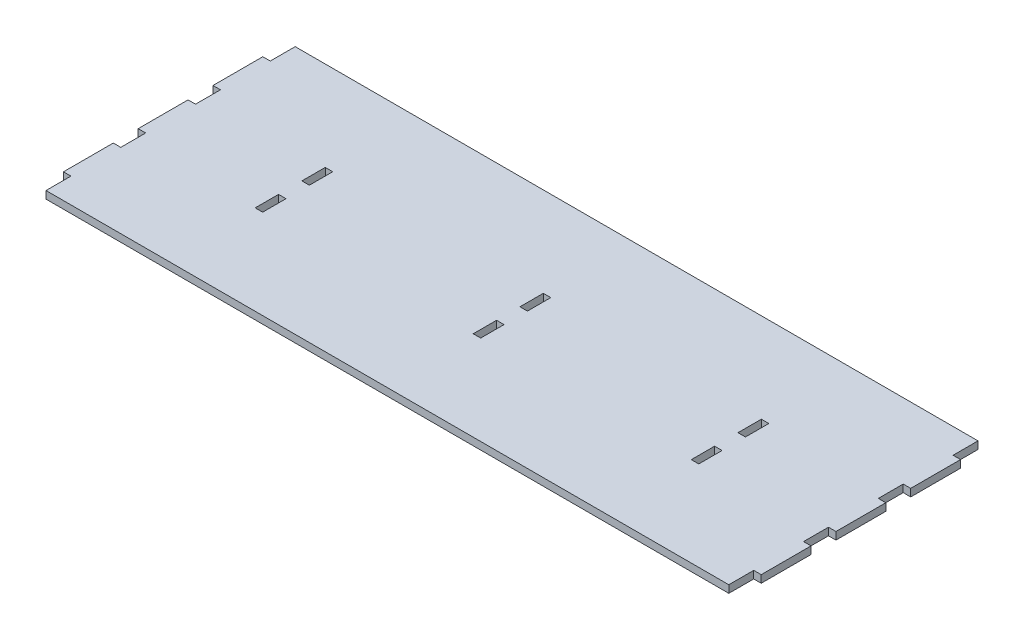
ISO-10303-21;
HEADER;
FILE_DESCRIPTION(('STEP AP214'),'2;1');
FILE_NAME('part.step','',(''),(''),'','','');
FILE_SCHEMA(('AUTOMOTIVE_DESIGN { 1 0 10303 214 1 1 1 1 }'));
ENDSEC;
DATA;
#1=APPLICATION_CONTEXT('core data for automotive mechanical design processes');
#2=APPLICATION_PROTOCOL_DEFINITION('international standard','automotive_design',2000,#1);
#3=PRODUCT_CONTEXT('',#1,'mechanical');
#4=PRODUCT('Part','Part','',(#3));
#5=PRODUCT_RELATED_PRODUCT_CATEGORY('part','',(#4));
#6=PRODUCT_DEFINITION_FORMATION('','',#4);
#7=PRODUCT_DEFINITION_CONTEXT('part definition',#1,'design');
#8=PRODUCT_DEFINITION('design','',#6,#7);
#9=PRODUCT_DEFINITION_SHAPE('','',#8);
#10=(LENGTH_UNIT() NAMED_UNIT(*) SI_UNIT(.MILLI.,.METRE.));
#11=(NAMED_UNIT(*) PLANE_ANGLE_UNIT() SI_UNIT($,.RADIAN.));
#12=(NAMED_UNIT(*) SI_UNIT($,.STERADIAN.) SOLID_ANGLE_UNIT());
#13=UNCERTAINTY_MEASURE_WITH_UNIT(LENGTH_MEASURE(1.E-05),#10,'distance_accuracy_value','');
#14=(GEOMETRIC_REPRESENTATION_CONTEXT(3) GLOBAL_UNCERTAINTY_ASSIGNED_CONTEXT((#13)) GLOBAL_UNIT_ASSIGNED_CONTEXT((#10,
#11,#12)) REPRESENTATION_CONTEXT('',''));
#15=CARTESIAN_POINT('',(0.,0.,0.));
#16=DIRECTION('',(0.,0.,1.));
#17=DIRECTION('',(1.,0.,0.));
#18=AXIS2_PLACEMENT_3D('',#15,#16,#17);
#19=CARTESIAN_POINT('',(0.,0.,0.));
#20=DIRECTION('',(0.,-1.,0.));
#21=DIRECTION('',(0.,0.,-1.));
#22=AXIS2_PLACEMENT_3D('',#19,#20,#21);
#23=PLANE('',#22);
#24=DIRECTION('',(0.,0.,-1.));
#25=VECTOR('',#24,1.);
#26=CARTESIAN_POINT('',(548.000000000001,0.,-159.999999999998));
#27=LINE('',#26,#25);
#28=CARTESIAN_POINT('',(548.000000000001,0.,-159.999999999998));
#29=VERTEX_POINT('',#28);
#30=CARTESIAN_POINT('',(548.,0.,-200.));
#31=VERTEX_POINT('',#30);
#32=EDGE_CURVE('E936',#29,#31,#27,.T.);
#33=ORIENTED_EDGE('',*,*,#32,.F.);
#34=DIRECTION('',(-1.,0.,0.));
#35=VECTOR('',#34,1.);
#36=CARTESIAN_POINT('',(548.000000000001,0.,-159.999999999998));
#37=LINE('',#36,#35);
#38=CARTESIAN_POINT('',(560.000000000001,0.,-159.999999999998));
#39=VERTEX_POINT('',#38);
#40=EDGE_CURVE('E974',#39,#29,#37,.T.);
#41=ORIENTED_EDGE('',*,*,#40,.F.);
#42=DIRECTION('',(0.,0.,-1.));
#43=VECTOR('',#42,1.);
#44=CARTESIAN_POINT('',(560.000000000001,0.,-79.9999999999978));
#45=LINE('',#44,#43);
#46=CARTESIAN_POINT('',(560.000000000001,0.,-79.9999999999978));
#47=VERTEX_POINT('',#46);
#48=EDGE_CURVE('E1134',#47,#39,#45,.T.);
#49=ORIENTED_EDGE('',*,*,#48,.F.);
#50=DIRECTION('',(1.,0.,0.));
#51=VECTOR('',#50,1.);
#52=CARTESIAN_POINT('',(548.000000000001,0.,-79.9999999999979));
#53=LINE('',#52,#51);
#54=CARTESIAN_POINT('',(548.000000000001,0.,-79.9999999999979));
#55=VERTEX_POINT('',#54);
#56=EDGE_CURVE('E1131',#55,#47,#53,.T.);
#57=ORIENTED_EDGE('',*,*,#56,.F.);
#58=DIRECTION('',(0.,0.,-1.));
#59=VECTOR('',#58,1.);
#60=CARTESIAN_POINT('',(548.,0.,-39.9999999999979));
#61=LINE('',#60,#59);
#62=CARTESIAN_POINT('',(548.,0.,-39.9999999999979));
#63=VERTEX_POINT('',#62);
#64=EDGE_CURVE('E1128',#63,#55,#61,.T.);
#65=ORIENTED_EDGE('',*,*,#64,.F.);
#66=DIRECTION('',(-1.,0.,0.));
#67=VECTOR('',#66,1.);
#68=CARTESIAN_POINT('',(548.,0.,-39.9999999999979));
#69=LINE('',#68,#67);
#70=CARTESIAN_POINT('',(560.,0.,-39.9999999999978));
#71=VERTEX_POINT('',#70);
#72=EDGE_CURVE('E1125',#71,#63,#69,.T.);
#73=ORIENTED_EDGE('',*,*,#72,.F.);
#74=DIRECTION('',(0.,0.,-1.));
#75=VECTOR('',#74,1.);
#76=CARTESIAN_POINT('',(560.,0.,40.0000000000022));
#77=LINE('',#76,#75);
#78=CARTESIAN_POINT('',(560.,0.,40.0000000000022));
#79=VERTEX_POINT('',#78);
#80=EDGE_CURVE('E1122',#79,#71,#77,.T.);
#81=ORIENTED_EDGE('',*,*,#80,.F.);
#82=DIRECTION('',(1.,0.,0.));
#83=VECTOR('',#82,1.);
#84=CARTESIAN_POINT('',(548.,0.,40.0000000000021));
#85=LINE('',#84,#83);
#86=CARTESIAN_POINT('',(548.,0.,40.0000000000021));
#87=VERTEX_POINT('',#86);
#88=EDGE_CURVE('E1119',#87,#79,#85,.T.);
#89=ORIENTED_EDGE('',*,*,#88,.F.);
#90=DIRECTION('',(0.,0.,-1.));
#91=VECTOR('',#90,1.);
#92=CARTESIAN_POINT('',(547.999999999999,0.,80.0000000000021));
#93=LINE('',#92,#91);
#94=CARTESIAN_POINT('',(547.999999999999,0.,80.0000000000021));
#95=VERTEX_POINT('',#94);
#96=EDGE_CURVE('E1116',#95,#87,#93,.T.);
#97=ORIENTED_EDGE('',*,*,#96,.F.);
#98=DIRECTION('',(-1.,0.,0.));
#99=VECTOR('',#98,1.);
#100=CARTESIAN_POINT('',(547.999999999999,0.,80.0000000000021));
#101=LINE('',#100,#99);
#102=CARTESIAN_POINT('',(559.999999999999,0.,80.0000000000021));
#103=VERTEX_POINT('',#102);
#104=EDGE_CURVE('E1113',#103,#95,#101,.T.);
#105=ORIENTED_EDGE('',*,*,#104,.F.);
#106=DIRECTION('',(0.,0.,-1.));
#107=VECTOR('',#106,1.);
#108=CARTESIAN_POINT('',(559.999999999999,0.,160.000000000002));
#109=LINE('',#108,#107);
#110=CARTESIAN_POINT('',(559.999999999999,0.,160.000000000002));
#111=VERTEX_POINT('',#110);
#112=EDGE_CURVE('E1110',#111,#103,#109,.T.);
#113=ORIENTED_EDGE('',*,*,#112,.F.);
#114=DIRECTION('',(1.,0.,0.));
#115=VECTOR('',#114,1.);
#116=CARTESIAN_POINT('',(547.999999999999,0.,160.000000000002));
#117=LINE('',#116,#115);
#118=CARTESIAN_POINT('',(547.999999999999,0.,160.000000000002));
#119=VERTEX_POINT('',#118);
#120=EDGE_CURVE('E1107',#119,#111,#117,.T.);
#121=ORIENTED_EDGE('',*,*,#120,.F.);
#122=DIRECTION('',(0.,0.,-1.));
#123=VECTOR('',#122,1.);
#124=CARTESIAN_POINT('',(548.,0.,200.));
#125=LINE('',#124,#123);
#126=CARTESIAN_POINT('',(548.,0.,200.));
#127=VERTEX_POINT('',#126);
#128=EDGE_CURVE('E1104',#127,#119,#125,.T.);
#129=ORIENTED_EDGE('',*,*,#128,.F.);
#130=DIRECTION('',(1.,0.,0.));
#131=VECTOR('',#130,1.);
#132=CARTESIAN_POINT('',(-548.,0.,200.));
#133=LINE('',#132,#131);
#134=CARTESIAN_POINT('',(-548.,0.,200.));
#135=VERTEX_POINT('',#134);
#136=EDGE_CURVE('E1101',#135,#127,#133,.T.);
#137=ORIENTED_EDGE('',*,*,#136,.F.);
#138=DIRECTION('',(0.,0.,1.));
#139=VECTOR('',#138,1.);
#140=CARTESIAN_POINT('',(-548.,0.,200.));
#141=LINE('',#140,#139);
#142=CARTESIAN_POINT('',(-548.,0.,160.));
#143=VERTEX_POINT('',#142);
#144=EDGE_CURVE('E1098',#143,#135,#141,.T.);
#145=ORIENTED_EDGE('',*,*,#144,.F.);
#146=DIRECTION('',(1.,0.,0.));
#147=VECTOR('',#146,1.);
#148=CARTESIAN_POINT('',(-548.,0.,160.));
#149=LINE('',#148,#147);
#150=CARTESIAN_POINT('',(-560.,0.,160.));
#151=VERTEX_POINT('',#150);
#152=EDGE_CURVE('E1095',#151,#143,#149,.T.);
#153=ORIENTED_EDGE('',*,*,#152,.F.);
#154=DIRECTION('',(0.,0.,1.));
#155=VECTOR('',#154,1.);
#156=CARTESIAN_POINT('',(-560.,0.,160.));
#157=LINE('',#156,#155);
#158=CARTESIAN_POINT('',(-560.,0.,80.));
#159=VERTEX_POINT('',#158);
#160=EDGE_CURVE('E1092',#159,#151,#157,.T.);
#161=ORIENTED_EDGE('',*,*,#160,.F.);
#162=DIRECTION('',(-1.,0.,0.));
#163=VECTOR('',#162,1.);
#164=CARTESIAN_POINT('',(-548.,0.,80.));
#165=LINE('',#164,#163);
#166=CARTESIAN_POINT('',(-548.,0.,80.));
#167=VERTEX_POINT('',#166);
#168=EDGE_CURVE('E1089',#167,#159,#165,.T.);
#169=ORIENTED_EDGE('',*,*,#168,.F.);
#170=DIRECTION('',(0.,0.,1.));
#171=VECTOR('',#170,1.);
#172=CARTESIAN_POINT('',(-548.,0.,80.));
#173=LINE('',#172,#171);
#174=CARTESIAN_POINT('',(-548.,0.,40.));
#175=VERTEX_POINT('',#174);
#176=EDGE_CURVE('E1086',#175,#167,#173,.T.);
#177=ORIENTED_EDGE('',*,*,#176,.F.);
#178=DIRECTION('',(1.,0.,0.));
#179=VECTOR('',#178,1.);
#180=CARTESIAN_POINT('',(-548.,0.,40.));
#181=LINE('',#180,#179);
#182=CARTESIAN_POINT('',(-560.,0.,40.));
#183=VERTEX_POINT('',#182);
#184=EDGE_CURVE('E1083',#183,#175,#181,.T.);
#185=ORIENTED_EDGE('',*,*,#184,.F.);
#186=DIRECTION('',(0.,0.,1.));
#187=VECTOR('',#186,1.);
#188=CARTESIAN_POINT('',(-560.,0.,40.));
#189=LINE('',#188,#187);
#190=CARTESIAN_POINT('',(-560.,0.,-40.));
#191=VERTEX_POINT('',#190);
#192=EDGE_CURVE('E1080',#191,#183,#189,.T.);
#193=ORIENTED_EDGE('',*,*,#192,.F.);
#194=DIRECTION('',(-1.,0.,0.));
#195=VECTOR('',#194,1.);
#196=CARTESIAN_POINT('',(-548.,0.,-40.));
#197=LINE('',#196,#195);
#198=CARTESIAN_POINT('',(-548.,0.,-40.));
#199=VERTEX_POINT('',#198);
#200=EDGE_CURVE('E1077',#199,#191,#197,.T.);
#201=ORIENTED_EDGE('',*,*,#200,.F.);
#202=DIRECTION('',(0.,0.,1.));
#203=VECTOR('',#202,1.);
#204=CARTESIAN_POINT('',(-548.,0.,-40.));
#205=LINE('',#204,#203);
#206=CARTESIAN_POINT('',(-548.000000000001,0.,-80.));
#207=VERTEX_POINT('',#206);
#208=EDGE_CURVE('E1074',#207,#199,#205,.T.);
#209=ORIENTED_EDGE('',*,*,#208,.F.);
#210=DIRECTION('',(1.,0.,0.));
#211=VECTOR('',#210,1.);
#212=CARTESIAN_POINT('',(-548.000000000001,0.,-80.));
#213=LINE('',#212,#211);
#214=CARTESIAN_POINT('',(-560.000000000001,0.,-80.));
#215=VERTEX_POINT('',#214);
#216=EDGE_CURVE('E1071',#215,#207,#213,.T.);
#217=ORIENTED_EDGE('',*,*,#216,.F.);
#218=DIRECTION('',(0.,0.,1.));
#219=VECTOR('',#218,1.);
#220=CARTESIAN_POINT('',(-560.000000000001,0.,-80.));
#221=LINE('',#220,#219);
#222=CARTESIAN_POINT('',(-560.000000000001,0.,-160.));
#223=VERTEX_POINT('',#222);
#224=EDGE_CURVE('E1068',#223,#215,#221,.T.);
#225=ORIENTED_EDGE('',*,*,#224,.F.);
#226=DIRECTION('',(-1.,0.,0.));
#227=VECTOR('',#226,1.);
#228=CARTESIAN_POINT('',(-548.000000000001,0.,-160.));
#229=LINE('',#228,#227);
#230=CARTESIAN_POINT('',(-548.000000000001,0.,-160.));
#231=VERTEX_POINT('',#230);
#232=EDGE_CURVE('E1065',#231,#223,#229,.T.);
#233=ORIENTED_EDGE('',*,*,#232,.F.);
#234=DIRECTION('',(0.,0.,1.));
#235=VECTOR('',#234,1.);
#236=CARTESIAN_POINT('',(-548.000000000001,0.,-160.));
#237=LINE('',#236,#235);
#238=CARTESIAN_POINT('',(-548.,0.,-200.));
#239=VERTEX_POINT('',#238);
#240=EDGE_CURVE('E1062',#239,#231,#237,.T.);
#241=ORIENTED_EDGE('',*,*,#240,.F.);
#242=DIRECTION('',(-1.,0.,0.));
#243=VECTOR('',#242,1.);
#244=CARTESIAN_POINT('',(-548.,0.,-200.));
#245=LINE('',#244,#243);
#246=EDGE_CURVE('E1059',#31,#239,#245,.T.);
#247=ORIENTED_EDGE('',*,*,#246,.F.);
#248=EDGE_LOOP('',(#33,#41,#49,#57,#65,#73,#81,#89,#97,#105,#113,#121,#129,#137,#145,#153,#161,
#169,#177,#185,#193,#201,#209,#217,#225,#233,#241,#247));
#249=FACE_BOUND('',#248,.T.);
#250=CARTESIAN_POINT('',(367.999999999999,0.,-13.9999999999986));
#251=DIRECTION('',(0.,-1.,0.));
#252=DIRECTION('',(0.,0.,-1.));
#253=AXIS2_PLACEMENT_3D('',#250,#251,#252);
#254=CIRCLE('',#253,146.500000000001);
#255=CARTESIAN_POINT('',(514.5,0.,-13.999999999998));
#256=VERTEX_POINT('',#255);
#257=CARTESIAN_POINT('',(367.999999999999,0.,-160.499999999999));
#258=VERTEX_POINT('',#257);
#259=EDGE_CURVE('E1294',#256,#258,#254,.F.);
#260=ORIENTED_EDGE('',*,*,#259,.T.);
#261=DIRECTION('',(-1.,0.,0.));
#262=VECTOR('',#261,1.);
#263=CARTESIAN_POINT('',(3.0868650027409E-13,0.,-160.5));
#264=LINE('',#263,#262);
#265=CARTESIAN_POINT('',(0.,0.,-160.5));
#266=VERTEX_POINT('',#265);
#267=EDGE_CURVE('E11',#258,#266,#264,.T.);
#268=ORIENTED_EDGE('',*,*,#267,.T.);
#269=DIRECTION('',(-1.,0.,0.));
#270=VECTOR('',#269,1.);
#271=CARTESIAN_POINT('',(3.0868650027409E-13,0.,-160.5));
#272=LINE('',#271,#270);
#273=CARTESIAN_POINT('',(-368.,0.,-160.500000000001));
#274=VERTEX_POINT('',#273);
#275=EDGE_CURVE('E54',#266,#274,#272,.T.);
#276=ORIENTED_EDGE('',*,*,#275,.T.);
#277=CARTESIAN_POINT('',(-368.,0.,-14.));
#278=DIRECTION('',(0.,-1.,0.));
#279=DIRECTION('',(0.,0.,-1.));
#280=AXIS2_PLACEMENT_3D('',#277,#278,#279);
#281=CIRCLE('',#280,146.500000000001);
#282=CARTESIAN_POINT('',(-514.500000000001,0.,-14.));
#283=VERTEX_POINT('',#282);
#284=EDGE_CURVE('E1326',#274,#283,#281,.F.);
#285=ORIENTED_EDGE('',*,*,#284,.T.);
#286=DIRECTION('',(0.,0.,1.));
#287=VECTOR('',#286,1.);
#288=CARTESIAN_POINT('',(-514.500000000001,0.,0.));
#289=LINE('',#288,#287);
#290=CARTESIAN_POINT('',(-514.500000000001,0.,0.));
#291=VERTEX_POINT('',#290);
#292=EDGE_CURVE('E1322',#283,#291,#289,.T.);
#293=ORIENTED_EDGE('',*,*,#292,.T.);
#294=DIRECTION('',(0.,0.,1.));
#295=VECTOR('',#294,1.);
#296=CARTESIAN_POINT('',(-514.500000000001,0.,0.));
#297=LINE('',#296,#295);
#298=CARTESIAN_POINT('',(-514.500000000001,0.,14.));
#299=VERTEX_POINT('',#298);
#300=EDGE_CURVE('E1318',#291,#299,#297,.T.);
#301=ORIENTED_EDGE('',*,*,#300,.T.);
#302=CARTESIAN_POINT('',(-368.,0.,14.));
#303=DIRECTION('',(0.,-1.,0.));
#304=DIRECTION('',(0.,0.,-1.));
#305=AXIS2_PLACEMENT_3D('',#302,#303,#304);
#306=CIRCLE('',#305,146.500000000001);
#307=CARTESIAN_POINT('',(-368.,0.,160.500000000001));
#308=VERTEX_POINT('',#307);
#309=EDGE_CURVE('E1314',#299,#308,#306,.F.);
#310=ORIENTED_EDGE('',*,*,#309,.T.);
#311=DIRECTION('',(1.,0.,0.));
#312=VECTOR('',#311,1.);
#313=CARTESIAN_POINT('',(-3.14739176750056E-13,0.,160.500000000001));
#314=LINE('',#313,#312);
#315=CARTESIAN_POINT('',(367.999999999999,0.,160.500000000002));
#316=VERTEX_POINT('',#315);
#317=EDGE_CURVE('E1310',#308,#316,#314,.T.);
#318=ORIENTED_EDGE('',*,*,#317,.T.);
#319=CARTESIAN_POINT('',(367.999999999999,0.,14.0000000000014));
#320=DIRECTION('',(0.,-1.,0.));
#321=DIRECTION('',(0.,0.,-1.));
#322=AXIS2_PLACEMENT_3D('',#319,#320,#321);
#323=CIRCLE('',#322,146.500000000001);
#324=CARTESIAN_POINT('',(514.5,0.,14.0000000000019));
#325=VERTEX_POINT('',#324);
#326=EDGE_CURVE('E1306',#316,#325,#323,.F.);
#327=ORIENTED_EDGE('',*,*,#326,.T.);
#328=DIRECTION('',(0.,0.,-1.));
#329=VECTOR('',#328,1.);
#330=CARTESIAN_POINT('',(514.5,0.,8.16013923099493E-12));
#331=LINE('',#330,#329);
#332=CARTESIAN_POINT('',(514.5,0.,2.04735889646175E-12));
#333=VERTEX_POINT('',#332);
#334=EDGE_CURVE('E1302',#325,#333,#331,.T.);
#335=ORIENTED_EDGE('',*,*,#334,.T.);
#336=DIRECTION('',(0.,0.,-1.));
#337=VECTOR('',#336,1.);
#338=CARTESIAN_POINT('',(514.5,0.,0.));
#339=LINE('',#338,#337);
#340=EDGE_CURVE('E1298',#333,#256,#339,.T.);
#341=ORIENTED_EDGE('',*,*,#340,.T.);
#342=EDGE_LOOP('',(#260,#268,#276,#285,#293,#301,#310,#318,#327,#335,#341));
#343=FACE_BOUND('',#342,.T.);
#344=ADVANCED_FACE('F45',(#249,#343),#23,.T.);
#345=CARTESIAN_POINT('',(548.000000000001,12.,-159.999999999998));
#346=DIRECTION('',(-1.,0.,0.));
#347=DIRECTION('',(0.,0.,1.));
#348=AXIS2_PLACEMENT_3D('',#345,#346,#347);
#349=PLANE('',#348);
#350=ORIENTED_EDGE('',*,*,#32,.T.);
#351=DIRECTION('',(0.,-1.,0.));
#352=VECTOR('',#351,1.);
#353=CARTESIAN_POINT('',(548.,12.,-200.));
#354=LINE('',#353,#352);
#355=CARTESIAN_POINT('',(548.,12.,-200.));
#356=VERTEX_POINT('',#355);
#357=EDGE_CURVE('E1246',#356,#31,#354,.T.);
#358=ORIENTED_EDGE('',*,*,#357,.F.);
#359=DIRECTION('',(0.,0.,-1.));
#360=VECTOR('',#359,1.);
#361=CARTESIAN_POINT('',(548.000000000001,12.,-159.999999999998));
#362=LINE('',#361,#360);
#363=CARTESIAN_POINT('',(548.000000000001,12.,-159.999999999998));
#364=VERTEX_POINT('',#363);
#365=EDGE_CURVE('E969',#364,#356,#362,.T.);
#366=ORIENTED_EDGE('',*,*,#365,.F.);
#367=DIRECTION('',(0.,-1.,0.));
#368=VECTOR('',#367,1.);
#369=CARTESIAN_POINT('',(548.000000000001,12.,-159.999999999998));
#370=LINE('',#369,#368);
#371=EDGE_CURVE('E1055',#364,#29,#370,.T.);
#372=ORIENTED_EDGE('',*,*,#371,.T.);
#373=EDGE_LOOP('',(#350,#358,#366,#372));
#374=FACE_BOUND('',#373,.T.);
#375=ADVANCED_FACE('F47',(#374),#349,.F.);
#376=CARTESIAN_POINT('',(-548.,12.,-200.));
#377=DIRECTION('',(0.,0.,1.));
#378=DIRECTION('',(1.,0.,0.));
#379=AXIS2_PLACEMENT_3D('',#376,#377,#378);
#380=PLANE('',#379);
#381=ORIENTED_EDGE('',*,*,#246,.T.);
#382=DIRECTION('',(0.,-1.,0.));
#383=VECTOR('',#382,1.);
#384=CARTESIAN_POINT('',(-548.,12.,-200.));
#385=LINE('',#384,#383);
#386=CARTESIAN_POINT('',(-548.,12.,-200.));
#387=VERTEX_POINT('',#386);
#388=EDGE_CURVE('E1242',#387,#239,#385,.T.);
#389=ORIENTED_EDGE('',*,*,#388,.F.);
#390=DIRECTION('',(-1.,0.,0.));
#391=VECTOR('',#390,1.);
#392=CARTESIAN_POINT('',(-548.,12.,-200.));
#393=LINE('',#392,#391);
#394=EDGE_CURVE('E973',#356,#387,#393,.T.);
#395=ORIENTED_EDGE('',*,*,#394,.F.);
#396=ORIENTED_EDGE('',*,*,#357,.T.);
#397=EDGE_LOOP('',(#381,#389,#395,#396));
#398=FACE_BOUND('',#397,.T.);
#399=ADVANCED_FACE('F1468',(#398),#380,.F.);
#400=CARTESIAN_POINT('',(-548.000000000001,12.,-160.));
#401=DIRECTION('',(1.,0.,0.));
#402=DIRECTION('',(0.,0.,-1.));
#403=AXIS2_PLACEMENT_3D('',#400,#401,#402);
#404=PLANE('',#403);
#405=ORIENTED_EDGE('',*,*,#240,.T.);
#406=DIRECTION('',(0.,-1.,0.));
#407=VECTOR('',#406,1.);
#408=CARTESIAN_POINT('',(-548.000000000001,12.,-160.));
#409=LINE('',#408,#407);
#410=CARTESIAN_POINT('',(-548.000000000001,12.,-160.));
#411=VERTEX_POINT('',#410);
#412=EDGE_CURVE('E1238',#411,#231,#409,.T.);
#413=ORIENTED_EDGE('',*,*,#412,.F.);
#414=DIRECTION('',(0.,0.,1.));
#415=VECTOR('',#414,1.);
#416=CARTESIAN_POINT('',(-548.000000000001,12.,-160.));
#417=LINE('',#416,#415);
#418=EDGE_CURVE('E977',#387,#411,#417,.T.);
#419=ORIENTED_EDGE('',*,*,#418,.F.);
#420=ORIENTED_EDGE('',*,*,#388,.T.);
#421=EDGE_LOOP('',(#405,#413,#419,#420));
#422=FACE_BOUND('',#421,.T.);
#423=ADVANCED_FACE('F2051',(#422),#404,.F.);
#424=CARTESIAN_POINT('',(-548.000000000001,12.,-160.));
#425=DIRECTION('',(0.,0.,1.));
#426=DIRECTION('',(1.,0.,0.));
#427=AXIS2_PLACEMENT_3D('',#424,#425,#426);
#428=PLANE('',#427);
#429=ORIENTED_EDGE('',*,*,#232,.T.);
#430=DIRECTION('',(0.,-1.,0.));
#431=VECTOR('',#430,1.);
#432=CARTESIAN_POINT('',(-560.000000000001,12.,-160.));
#433=LINE('',#432,#431);
#434=CARTESIAN_POINT('',(-560.000000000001,12.,-160.));
#435=VERTEX_POINT('',#434);
#436=EDGE_CURVE('E1234',#435,#223,#433,.T.);
#437=ORIENTED_EDGE('',*,*,#436,.F.);
#438=DIRECTION('',(-1.,0.,0.));
#439=VECTOR('',#438,1.);
#440=CARTESIAN_POINT('',(-548.000000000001,12.,-160.));
#441=LINE('',#440,#439);
#442=EDGE_CURVE('E980',#411,#435,#441,.T.);
#443=ORIENTED_EDGE('',*,*,#442,.F.);
#444=ORIENTED_EDGE('',*,*,#412,.T.);
#445=EDGE_LOOP('',(#429,#437,#443,#444));
#446=FACE_BOUND('',#445,.T.);
#447=ADVANCED_FACE('F2057',(#446),#428,.F.);
#448=CARTESIAN_POINT('',(-560.000000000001,12.,-80.));
#449=DIRECTION('',(1.,0.,0.));
#450=DIRECTION('',(0.,0.,-1.));
#451=AXIS2_PLACEMENT_3D('',#448,#449,#450);
#452=PLANE('',#451);
#453=ORIENTED_EDGE('',*,*,#224,.T.);
#454=DIRECTION('',(0.,-1.,0.));
#455=VECTOR('',#454,1.);
#456=CARTESIAN_POINT('',(-560.000000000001,12.,-80.));
#457=LINE('',#456,#455);
#458=CARTESIAN_POINT('',(-560.000000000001,12.,-80.));
#459=VERTEX_POINT('',#458);
#460=EDGE_CURVE('E1230',#459,#215,#457,.T.);
#461=ORIENTED_EDGE('',*,*,#460,.F.);
#462=DIRECTION('',(0.,0.,1.));
#463=VECTOR('',#462,1.);
#464=CARTESIAN_POINT('',(-560.000000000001,12.,-80.));
#465=LINE('',#464,#463);
#466=EDGE_CURVE('E983',#435,#459,#465,.T.);
#467=ORIENTED_EDGE('',*,*,#466,.F.);
#468=ORIENTED_EDGE('',*,*,#436,.T.);
#469=EDGE_LOOP('',(#453,#461,#467,#468));
#470=FACE_BOUND('',#469,.T.);
#471=ADVANCED_FACE('F2061',(#470),#452,.F.);
#472=CARTESIAN_POINT('',(-548.000000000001,12.,-80.));
#473=DIRECTION('',(0.,0.,-1.));
#474=DIRECTION('',(-1.,0.,0.));
#475=AXIS2_PLACEMENT_3D('',#472,#473,#474);
#476=PLANE('',#475);
#477=ORIENTED_EDGE('',*,*,#216,.T.);
#478=DIRECTION('',(0.,-1.,0.));
#479=VECTOR('',#478,1.);
#480=CARTESIAN_POINT('',(-548.000000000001,12.,-80.));
#481=LINE('',#480,#479);
#482=CARTESIAN_POINT('',(-548.000000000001,12.,-80.));
#483=VERTEX_POINT('',#482);
#484=EDGE_CURVE('E1226',#483,#207,#481,.T.);
#485=ORIENTED_EDGE('',*,*,#484,.F.);
#486=DIRECTION('',(1.,0.,0.));
#487=VECTOR('',#486,1.);
#488=CARTESIAN_POINT('',(-548.000000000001,12.,-80.));
#489=LINE('',#488,#487);
#490=EDGE_CURVE('E986',#459,#483,#489,.T.);
#491=ORIENTED_EDGE('',*,*,#490,.F.);
#492=ORIENTED_EDGE('',*,*,#460,.T.);
#493=EDGE_LOOP('',(#477,#485,#491,#492));
#494=FACE_BOUND('',#493,.T.);
#495=ADVANCED_FACE('F2066',(#494),#476,.F.);
#496=CARTESIAN_POINT('',(-548.,12.,-40.));
#497=DIRECTION('',(1.,0.,0.));
#498=DIRECTION('',(0.,0.,-1.));
#499=AXIS2_PLACEMENT_3D('',#496,#497,#498);
#500=PLANE('',#499);
#501=ORIENTED_EDGE('',*,*,#208,.T.);
#502=DIRECTION('',(0.,-1.,0.));
#503=VECTOR('',#502,1.);
#504=CARTESIAN_POINT('',(-548.,12.,-40.));
#505=LINE('',#504,#503);
#506=CARTESIAN_POINT('',(-548.,12.,-40.));
#507=VERTEX_POINT('',#506);
#508=EDGE_CURVE('E1222',#507,#199,#505,.T.);
#509=ORIENTED_EDGE('',*,*,#508,.F.);
#510=DIRECTION('',(0.,0.,1.));
#511=VECTOR('',#510,1.);
#512=CARTESIAN_POINT('',(-548.,12.,-40.));
#513=LINE('',#512,#511);
#514=EDGE_CURVE('E989',#483,#507,#513,.T.);
#515=ORIENTED_EDGE('',*,*,#514,.F.);
#516=ORIENTED_EDGE('',*,*,#484,.T.);
#517=EDGE_LOOP('',(#501,#509,#515,#516));
#518=FACE_BOUND('',#517,.T.);
#519=ADVANCED_FACE('F2072',(#518),#500,.F.);
#520=CARTESIAN_POINT('',(-548.,12.,-40.));
#521=DIRECTION('',(0.,0.,1.));
#522=DIRECTION('',(1.,0.,0.));
#523=AXIS2_PLACEMENT_3D('',#520,#521,#522);
#524=PLANE('',#523);
#525=ORIENTED_EDGE('',*,*,#200,.T.);
#526=DIRECTION('',(0.,-1.,0.));
#527=VECTOR('',#526,1.);
#528=CARTESIAN_POINT('',(-560.,12.,-40.));
#529=LINE('',#528,#527);
#530=CARTESIAN_POINT('',(-560.,12.,-40.));
#531=VERTEX_POINT('',#530);
#532=EDGE_CURVE('E1218',#531,#191,#529,.T.);
#533=ORIENTED_EDGE('',*,*,#532,.F.);
#534=DIRECTION('',(-1.,0.,0.));
#535=VECTOR('',#534,1.);
#536=CARTESIAN_POINT('',(-548.,12.,-40.));
#537=LINE('',#536,#535);
#538=EDGE_CURVE('E992',#507,#531,#537,.T.);
#539=ORIENTED_EDGE('',*,*,#538,.F.);
#540=ORIENTED_EDGE('',*,*,#508,.T.);
#541=EDGE_LOOP('',(#525,#533,#539,#540));
#542=FACE_BOUND('',#541,.T.);
#543=ADVANCED_FACE('F2076',(#542),#524,.F.);
#544=CARTESIAN_POINT('',(-560.,12.,40.));
#545=DIRECTION('',(1.,0.,0.));
#546=DIRECTION('',(0.,0.,-1.));
#547=AXIS2_PLACEMENT_3D('',#544,#545,#546);
#548=PLANE('',#547);
#549=ORIENTED_EDGE('',*,*,#192,.T.);
#550=DIRECTION('',(0.,-1.,0.));
#551=VECTOR('',#550,1.);
#552=CARTESIAN_POINT('',(-560.,12.,40.));
#553=LINE('',#552,#551);
#554=CARTESIAN_POINT('',(-560.,12.,40.));
#555=VERTEX_POINT('',#554);
#556=EDGE_CURVE('E1214',#555,#183,#553,.T.);
#557=ORIENTED_EDGE('',*,*,#556,.F.);
#558=DIRECTION('',(0.,0.,1.));
#559=VECTOR('',#558,1.);
#560=CARTESIAN_POINT('',(-560.,12.,40.));
#561=LINE('',#560,#559);
#562=EDGE_CURVE('E995',#531,#555,#561,.T.);
#563=ORIENTED_EDGE('',*,*,#562,.F.);
#564=ORIENTED_EDGE('',*,*,#532,.T.);
#565=EDGE_LOOP('',(#549,#557,#563,#564));
#566=FACE_BOUND('',#565,.T.);
#567=ADVANCED_FACE('F2081',(#566),#548,.F.);
#568=CARTESIAN_POINT('',(-548.,12.,40.));
#569=DIRECTION('',(0.,0.,-1.));
#570=DIRECTION('',(-1.,0.,0.));
#571=AXIS2_PLACEMENT_3D('',#568,#569,#570);
#572=PLANE('',#571);
#573=ORIENTED_EDGE('',*,*,#184,.T.);
#574=DIRECTION('',(0.,-1.,0.));
#575=VECTOR('',#574,1.);
#576=CARTESIAN_POINT('',(-548.,12.,40.));
#577=LINE('',#576,#575);
#578=CARTESIAN_POINT('',(-548.,12.,40.));
#579=VERTEX_POINT('',#578);
#580=EDGE_CURVE('E1210',#579,#175,#577,.T.);
#581=ORIENTED_EDGE('',*,*,#580,.F.);
#582=DIRECTION('',(1.,0.,0.));
#583=VECTOR('',#582,1.);
#584=CARTESIAN_POINT('',(-548.,12.,40.));
#585=LINE('',#584,#583);
#586=EDGE_CURVE('E998',#555,#579,#585,.T.);
#587=ORIENTED_EDGE('',*,*,#586,.F.);
#588=ORIENTED_EDGE('',*,*,#556,.T.);
#589=EDGE_LOOP('',(#573,#581,#587,#588));
#590=FACE_BOUND('',#589,.T.);
#591=ADVANCED_FACE('F2087',(#590),#572,.F.);
#592=CARTESIAN_POINT('',(-548.,12.,80.));
#593=DIRECTION('',(1.,0.,0.));
#594=DIRECTION('',(0.,0.,-1.));
#595=AXIS2_PLACEMENT_3D('',#592,#593,#594);
#596=PLANE('',#595);
#597=ORIENTED_EDGE('',*,*,#176,.T.);
#598=DIRECTION('',(0.,-1.,0.));
#599=VECTOR('',#598,1.);
#600=CARTESIAN_POINT('',(-548.,12.,80.));
#601=LINE('',#600,#599);
#602=CARTESIAN_POINT('',(-548.,12.,80.));
#603=VERTEX_POINT('',#602);
#604=EDGE_CURVE('E1206',#603,#167,#601,.T.);
#605=ORIENTED_EDGE('',*,*,#604,.F.);
#606=DIRECTION('',(0.,0.,1.));
#607=VECTOR('',#606,1.);
#608=CARTESIAN_POINT('',(-548.,12.,80.));
#609=LINE('',#608,#607);
#610=EDGE_CURVE('E1001',#579,#603,#609,.T.);
#611=ORIENTED_EDGE('',*,*,#610,.F.);
#612=ORIENTED_EDGE('',*,*,#580,.T.);
#613=EDGE_LOOP('',(#597,#605,#611,#612));
#614=FACE_BOUND('',#613,.T.);
#615=ADVANCED_FACE('F2091',(#614),#596,.F.);
#616=CARTESIAN_POINT('',(-548.,12.,80.));
#617=DIRECTION('',(0.,0.,1.));
#618=DIRECTION('',(1.,0.,0.));
#619=AXIS2_PLACEMENT_3D('',#616,#617,#618);
#620=PLANE('',#619);
#621=ORIENTED_EDGE('',*,*,#168,.T.);
#622=DIRECTION('',(0.,-1.,0.));
#623=VECTOR('',#622,1.);
#624=CARTESIAN_POINT('',(-560.,12.,80.));
#625=LINE('',#624,#623);
#626=CARTESIAN_POINT('',(-560.,12.,80.));
#627=VERTEX_POINT('',#626);
#628=EDGE_CURVE('E1202',#627,#159,#625,.T.);
#629=ORIENTED_EDGE('',*,*,#628,.F.);
#630=DIRECTION('',(-1.,0.,0.));
#631=VECTOR('',#630,1.);
#632=CARTESIAN_POINT('',(-548.,12.,80.));
#633=LINE('',#632,#631);
#634=EDGE_CURVE('E1004',#603,#627,#633,.T.);
#635=ORIENTED_EDGE('',*,*,#634,.F.);
#636=ORIENTED_EDGE('',*,*,#604,.T.);
#637=EDGE_LOOP('',(#621,#629,#635,#636));
#638=FACE_BOUND('',#637,.T.);
#639=ADVANCED_FACE('F2096',(#638),#620,.F.);
#640=CARTESIAN_POINT('',(-560.,12.,160.));
#641=DIRECTION('',(1.,0.,0.));
#642=DIRECTION('',(0.,0.,-1.));
#643=AXIS2_PLACEMENT_3D('',#640,#641,#642);
#644=PLANE('',#643);
#645=ORIENTED_EDGE('',*,*,#160,.T.);
#646=DIRECTION('',(0.,-1.,0.));
#647=VECTOR('',#646,1.);
#648=CARTESIAN_POINT('',(-560.,12.,160.));
#649=LINE('',#648,#647);
#650=CARTESIAN_POINT('',(-560.,12.,160.));
#651=VERTEX_POINT('',#650);
#652=EDGE_CURVE('E1198',#651,#151,#649,.T.);
#653=ORIENTED_EDGE('',*,*,#652,.F.);
#654=DIRECTION('',(0.,0.,1.));
#655=VECTOR('',#654,1.);
#656=CARTESIAN_POINT('',(-560.,12.,160.));
#657=LINE('',#656,#655);
#658=EDGE_CURVE('E1007',#627,#651,#657,.T.);
#659=ORIENTED_EDGE('',*,*,#658,.F.);
#660=ORIENTED_EDGE('',*,*,#628,.T.);
#661=EDGE_LOOP('',(#645,#653,#659,#660));
#662=FACE_BOUND('',#661,.T.);
#663=ADVANCED_FACE('F2102',(#662),#644,.F.);
#664=CARTESIAN_POINT('',(-548.,12.,160.));
#665=DIRECTION('',(0.,0.,-1.));
#666=DIRECTION('',(-1.,0.,0.));
#667=AXIS2_PLACEMENT_3D('',#664,#665,#666);
#668=PLANE('',#667);
#669=ORIENTED_EDGE('',*,*,#152,.T.);
#670=DIRECTION('',(0.,-1.,0.));
#671=VECTOR('',#670,1.);
#672=CARTESIAN_POINT('',(-548.,12.,160.));
#673=LINE('',#672,#671);
#674=CARTESIAN_POINT('',(-548.,12.,160.));
#675=VERTEX_POINT('',#674);
#676=EDGE_CURVE('E1194',#675,#143,#673,.T.);
#677=ORIENTED_EDGE('',*,*,#676,.F.);
#678=DIRECTION('',(1.,0.,0.));
#679=VECTOR('',#678,1.);
#680=CARTESIAN_POINT('',(-548.,12.,160.));
#681=LINE('',#680,#679);
#682=EDGE_CURVE('E1010',#651,#675,#681,.T.);
#683=ORIENTED_EDGE('',*,*,#682,.F.);
#684=ORIENTED_EDGE('',*,*,#652,.T.);
#685=EDGE_LOOP('',(#669,#677,#683,#684));
#686=FACE_BOUND('',#685,.T.);
#687=ADVANCED_FACE('F2106',(#686),#668,.F.);
#688=CARTESIAN_POINT('',(-548.,12.,200.));
#689=DIRECTION('',(1.,0.,0.));
#690=DIRECTION('',(0.,0.,-1.));
#691=AXIS2_PLACEMENT_3D('',#688,#689,#690);
#692=PLANE('',#691);
#693=ORIENTED_EDGE('',*,*,#144,.T.);
#694=DIRECTION('',(0.,-1.,0.));
#695=VECTOR('',#694,1.);
#696=CARTESIAN_POINT('',(-548.,12.,200.));
#697=LINE('',#696,#695);
#698=CARTESIAN_POINT('',(-548.,12.,200.));
#699=VERTEX_POINT('',#698);
#700=EDGE_CURVE('E1190',#699,#135,#697,.T.);
#701=ORIENTED_EDGE('',*,*,#700,.F.);
#702=DIRECTION('',(0.,0.,1.));
#703=VECTOR('',#702,1.);
#704=CARTESIAN_POINT('',(-548.,12.,200.));
#705=LINE('',#704,#703);
#706=EDGE_CURVE('E1013',#675,#699,#705,.T.);
#707=ORIENTED_EDGE('',*,*,#706,.F.);
#708=ORIENTED_EDGE('',*,*,#676,.T.);
#709=EDGE_LOOP('',(#693,#701,#707,#708));
#710=FACE_BOUND('',#709,.T.);
#711=ADVANCED_FACE('F2111',(#710),#692,.F.);
#712=CARTESIAN_POINT('',(-548.,12.,200.));
#713=DIRECTION('',(0.,0.,-1.));
#714=DIRECTION('',(-1.,0.,0.));
#715=AXIS2_PLACEMENT_3D('',#712,#713,#714);
#716=PLANE('',#715);
#717=ORIENTED_EDGE('',*,*,#136,.T.);
#718=DIRECTION('',(0.,-1.,0.));
#719=VECTOR('',#718,1.);
#720=CARTESIAN_POINT('',(548.,12.,200.));
#721=LINE('',#720,#719);
#722=CARTESIAN_POINT('',(548.,12.,200.));
#723=VERTEX_POINT('',#722);
#724=EDGE_CURVE('E1186',#723,#127,#721,.T.);
#725=ORIENTED_EDGE('',*,*,#724,.F.);
#726=DIRECTION('',(1.,0.,0.));
#727=VECTOR('',#726,1.);
#728=CARTESIAN_POINT('',(-548.,12.,200.));
#729=LINE('',#728,#727);
#730=EDGE_CURVE('E1016',#699,#723,#729,.T.);
#731=ORIENTED_EDGE('',*,*,#730,.F.);
#732=ORIENTED_EDGE('',*,*,#700,.T.);
#733=EDGE_LOOP('',(#717,#725,#731,#732));
#734=FACE_BOUND('',#733,.T.);
#735=ADVANCED_FACE('F2117',(#734),#716,.F.);
#736=CARTESIAN_POINT('',(548.,12.,200.));
#737=DIRECTION('',(-1.,0.,0.));
#738=DIRECTION('',(0.,0.,1.));
#739=AXIS2_PLACEMENT_3D('',#736,#737,#738);
#740=PLANE('',#739);
#741=ORIENTED_EDGE('',*,*,#128,.T.);
#742=DIRECTION('',(0.,-1.,0.));
#743=VECTOR('',#742,1.);
#744=CARTESIAN_POINT('',(547.999999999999,12.,160.000000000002));
#745=LINE('',#744,#743);
#746=CARTESIAN_POINT('',(547.999999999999,12.,160.000000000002));
#747=VERTEX_POINT('',#746);
#748=EDGE_CURVE('E1182',#747,#119,#745,.T.);
#749=ORIENTED_EDGE('',*,*,#748,.F.);
#750=DIRECTION('',(0.,0.,-1.));
#751=VECTOR('',#750,1.);
#752=CARTESIAN_POINT('',(548.,12.,200.));
#753=LINE('',#752,#751);
#754=EDGE_CURVE('E1019',#723,#747,#753,.T.);
#755=ORIENTED_EDGE('',*,*,#754,.F.);
#756=ORIENTED_EDGE('',*,*,#724,.T.);
#757=EDGE_LOOP('',(#741,#749,#755,#756));
#758=FACE_BOUND('',#757,.T.);
#759=ADVANCED_FACE('F2121',(#758),#740,.F.);
#760=CARTESIAN_POINT('',(547.999999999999,12.,160.000000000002));
#761=DIRECTION('',(0.,0.,-1.));
#762=DIRECTION('',(-1.,0.,0.));
#763=AXIS2_PLACEMENT_3D('',#760,#761,#762);
#764=PLANE('',#763);
#765=ORIENTED_EDGE('',*,*,#120,.T.);
#766=DIRECTION('',(0.,-1.,0.));
#767=VECTOR('',#766,1.);
#768=CARTESIAN_POINT('',(559.999999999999,12.,160.000000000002));
#769=LINE('',#768,#767);
#770=CARTESIAN_POINT('',(559.999999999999,12.,160.000000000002));
#771=VERTEX_POINT('',#770);
#772=EDGE_CURVE('E1178',#771,#111,#769,.T.);
#773=ORIENTED_EDGE('',*,*,#772,.F.);
#774=DIRECTION('',(1.,0.,0.));
#775=VECTOR('',#774,1.);
#776=CARTESIAN_POINT('',(547.999999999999,12.,160.000000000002));
#777=LINE('',#776,#775);
#778=EDGE_CURVE('E1022',#747,#771,#777,.T.);
#779=ORIENTED_EDGE('',*,*,#778,.F.);
#780=ORIENTED_EDGE('',*,*,#748,.T.);
#781=EDGE_LOOP('',(#765,#773,#779,#780));
#782=FACE_BOUND('',#781,.T.);
#783=ADVANCED_FACE('F2126',(#782),#764,.F.);
#784=CARTESIAN_POINT('',(559.999999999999,12.,160.000000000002));
#785=DIRECTION('',(-1.,0.,0.));
#786=DIRECTION('',(0.,0.,1.));
#787=AXIS2_PLACEMENT_3D('',#784,#785,#786);
#788=PLANE('',#787);
#789=ORIENTED_EDGE('',*,*,#112,.T.);
#790=DIRECTION('',(0.,-1.,0.));
#791=VECTOR('',#790,1.);
#792=CARTESIAN_POINT('',(559.999999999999,12.,80.0000000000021));
#793=LINE('',#792,#791);
#794=CARTESIAN_POINT('',(559.999999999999,12.,80.0000000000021));
#795=VERTEX_POINT('',#794);
#796=EDGE_CURVE('E1174',#795,#103,#793,.T.);
#797=ORIENTED_EDGE('',*,*,#796,.F.);
#798=DIRECTION('',(0.,0.,-1.));
#799=VECTOR('',#798,1.);
#800=CARTESIAN_POINT('',(559.999999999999,12.,160.000000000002));
#801=LINE('',#800,#799);
#802=EDGE_CURVE('E1025',#771,#795,#801,.T.);
#803=ORIENTED_EDGE('',*,*,#802,.F.);
#804=ORIENTED_EDGE('',*,*,#772,.T.);
#805=EDGE_LOOP('',(#789,#797,#803,#804));
#806=FACE_BOUND('',#805,.T.);
#807=ADVANCED_FACE('F2132',(#806),#788,.F.);
#808=CARTESIAN_POINT('',(547.999999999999,12.,80.0000000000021));
#809=DIRECTION('',(0.,0.,1.));
#810=DIRECTION('',(1.,0.,0.));
#811=AXIS2_PLACEMENT_3D('',#808,#809,#810);
#812=PLANE('',#811);
#813=ORIENTED_EDGE('',*,*,#104,.T.);
#814=DIRECTION('',(0.,-1.,0.));
#815=VECTOR('',#814,1.);
#816=CARTESIAN_POINT('',(547.999999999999,12.,80.0000000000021));
#817=LINE('',#816,#815);
#818=CARTESIAN_POINT('',(547.999999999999,12.,80.0000000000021));
#819=VERTEX_POINT('',#818);
#820=EDGE_CURVE('E1170',#819,#95,#817,.T.);
#821=ORIENTED_EDGE('',*,*,#820,.F.);
#822=DIRECTION('',(-1.,0.,0.));
#823=VECTOR('',#822,1.);
#824=CARTESIAN_POINT('',(547.999999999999,12.,80.0000000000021));
#825=LINE('',#824,#823);
#826=EDGE_CURVE('E1028',#795,#819,#825,.T.);
#827=ORIENTED_EDGE('',*,*,#826,.F.);
#828=ORIENTED_EDGE('',*,*,#796,.T.);
#829=EDGE_LOOP('',(#813,#821,#827,#828));
#830=FACE_BOUND('',#829,.T.);
#831=ADVANCED_FACE('F2136',(#830),#812,.F.);
#832=CARTESIAN_POINT('',(547.999999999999,12.,80.0000000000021));
#833=DIRECTION('',(-1.,0.,0.));
#834=DIRECTION('',(0.,0.,1.));
#835=AXIS2_PLACEMENT_3D('',#832,#833,#834);
#836=PLANE('',#835);
#837=ORIENTED_EDGE('',*,*,#96,.T.);
#838=DIRECTION('',(0.,-1.,0.));
#839=VECTOR('',#838,1.);
#840=CARTESIAN_POINT('',(548.,12.,40.0000000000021));
#841=LINE('',#840,#839);
#842=CARTESIAN_POINT('',(548.,12.,40.0000000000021));
#843=VERTEX_POINT('',#842);
#844=EDGE_CURVE('E1166',#843,#87,#841,.T.);
#845=ORIENTED_EDGE('',*,*,#844,.F.);
#846=DIRECTION('',(0.,0.,-1.));
#847=VECTOR('',#846,1.);
#848=CARTESIAN_POINT('',(547.999999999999,12.,80.0000000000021));
#849=LINE('',#848,#847);
#850=EDGE_CURVE('E1031',#819,#843,#849,.T.);
#851=ORIENTED_EDGE('',*,*,#850,.F.);
#852=ORIENTED_EDGE('',*,*,#820,.T.);
#853=EDGE_LOOP('',(#837,#845,#851,#852));
#854=FACE_BOUND('',#853,.T.);
#855=ADVANCED_FACE('F2141',(#854),#836,.F.);
#856=CARTESIAN_POINT('',(548.,12.,40.0000000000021));
#857=DIRECTION('',(0.,0.,-1.));
#858=DIRECTION('',(-1.,0.,0.));
#859=AXIS2_PLACEMENT_3D('',#856,#857,#858);
#860=PLANE('',#859);
#861=ORIENTED_EDGE('',*,*,#88,.T.);
#862=DIRECTION('',(0.,-1.,0.));
#863=VECTOR('',#862,1.);
#864=CARTESIAN_POINT('',(560.,12.,40.0000000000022));
#865=LINE('',#864,#863);
#866=CARTESIAN_POINT('',(560.,12.,40.0000000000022));
#867=VERTEX_POINT('',#866);
#868=EDGE_CURVE('E1162',#867,#79,#865,.T.);
#869=ORIENTED_EDGE('',*,*,#868,.F.);
#870=DIRECTION('',(1.,0.,0.));
#871=VECTOR('',#870,1.);
#872=CARTESIAN_POINT('',(548.,12.,40.0000000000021));
#873=LINE('',#872,#871);
#874=EDGE_CURVE('E1034',#843,#867,#873,.T.);
#875=ORIENTED_EDGE('',*,*,#874,.F.);
#876=ORIENTED_EDGE('',*,*,#844,.T.);
#877=EDGE_LOOP('',(#861,#869,#875,#876));
#878=FACE_BOUND('',#877,.T.);
#879=ADVANCED_FACE('F2147',(#878),#860,.F.);
#880=CARTESIAN_POINT('',(560.,12.,40.0000000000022));
#881=DIRECTION('',(-1.,0.,0.));
#882=DIRECTION('',(0.,0.,1.));
#883=AXIS2_PLACEMENT_3D('',#880,#881,#882);
#884=PLANE('',#883);
#885=ORIENTED_EDGE('',*,*,#80,.T.);
#886=DIRECTION('',(0.,-1.,0.));
#887=VECTOR('',#886,1.);
#888=CARTESIAN_POINT('',(560.,12.,-39.9999999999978));
#889=LINE('',#888,#887);
#890=CARTESIAN_POINT('',(560.,12.,-39.9999999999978));
#891=VERTEX_POINT('',#890);
#892=EDGE_CURVE('E1158',#891,#71,#889,.T.);
#893=ORIENTED_EDGE('',*,*,#892,.F.);
#894=DIRECTION('',(0.,0.,-1.));
#895=VECTOR('',#894,1.);
#896=CARTESIAN_POINT('',(560.,12.,40.0000000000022));
#897=LINE('',#896,#895);
#898=EDGE_CURVE('E1037',#867,#891,#897,.T.);
#899=ORIENTED_EDGE('',*,*,#898,.F.);
#900=ORIENTED_EDGE('',*,*,#868,.T.);
#901=EDGE_LOOP('',(#885,#893,#899,#900));
#902=FACE_BOUND('',#901,.T.);
#903=ADVANCED_FACE('F2151',(#902),#884,.F.);
#904=CARTESIAN_POINT('',(548.,12.,-39.9999999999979));
#905=DIRECTION('',(0.,0.,1.));
#906=DIRECTION('',(1.,0.,0.));
#907=AXIS2_PLACEMENT_3D('',#904,#905,#906);
#908=PLANE('',#907);
#909=ORIENTED_EDGE('',*,*,#72,.T.);
#910=DIRECTION('',(0.,-1.,0.));
#911=VECTOR('',#910,1.);
#912=CARTESIAN_POINT('',(548.,12.,-39.9999999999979));
#913=LINE('',#912,#911);
#914=CARTESIAN_POINT('',(548.,12.,-39.9999999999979));
#915=VERTEX_POINT('',#914);
#916=EDGE_CURVE('E1154',#915,#63,#913,.T.);
#917=ORIENTED_EDGE('',*,*,#916,.F.);
#918=DIRECTION('',(-1.,0.,0.));
#919=VECTOR('',#918,1.);
#920=CARTESIAN_POINT('',(548.,12.,-39.9999999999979));
#921=LINE('',#920,#919);
#922=EDGE_CURVE('E1040',#891,#915,#921,.T.);
#923=ORIENTED_EDGE('',*,*,#922,.F.);
#924=ORIENTED_EDGE('',*,*,#892,.T.);
#925=EDGE_LOOP('',(#909,#917,#923,#924));
#926=FACE_BOUND('',#925,.T.);
#927=ADVANCED_FACE('F2156',(#926),#908,.F.);
#928=CARTESIAN_POINT('',(548.,12.,-39.9999999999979));
#929=DIRECTION('',(-1.,0.,0.));
#930=DIRECTION('',(0.,0.,1.));
#931=AXIS2_PLACEMENT_3D('',#928,#929,#930);
#932=PLANE('',#931);
#933=ORIENTED_EDGE('',*,*,#64,.T.);
#934=DIRECTION('',(0.,-1.,0.));
#935=VECTOR('',#934,1.);
#936=CARTESIAN_POINT('',(548.000000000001,12.,-79.9999999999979));
#937=LINE('',#936,#935);
#938=CARTESIAN_POINT('',(548.000000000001,12.,-79.9999999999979));
#939=VERTEX_POINT('',#938);
#940=EDGE_CURVE('E1150',#939,#55,#937,.T.);
#941=ORIENTED_EDGE('',*,*,#940,.F.);
#942=DIRECTION('',(0.,0.,-1.));
#943=VECTOR('',#942,1.);
#944=CARTESIAN_POINT('',(548.,12.,-39.9999999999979));
#945=LINE('',#944,#943);
#946=EDGE_CURVE('E1043',#915,#939,#945,.T.);
#947=ORIENTED_EDGE('',*,*,#946,.F.);
#948=ORIENTED_EDGE('',*,*,#916,.T.);
#949=EDGE_LOOP('',(#933,#941,#947,#948));
#950=FACE_BOUND('',#949,.T.);
#951=ADVANCED_FACE('F2162',(#950),#932,.F.);
#952=CARTESIAN_POINT('',(548.000000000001,12.,-79.9999999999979));
#953=DIRECTION('',(0.,0.,-1.));
#954=DIRECTION('',(-1.,0.,0.));
#955=AXIS2_PLACEMENT_3D('',#952,#953,#954);
#956=PLANE('',#955);
#957=ORIENTED_EDGE('',*,*,#56,.T.);
#958=DIRECTION('',(0.,-1.,0.));
#959=VECTOR('',#958,1.);
#960=CARTESIAN_POINT('',(560.000000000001,12.,-79.9999999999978));
#961=LINE('',#960,#959);
#962=CARTESIAN_POINT('',(560.000000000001,12.,-79.9999999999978));
#963=VERTEX_POINT('',#962);
#964=EDGE_CURVE('E1146',#963,#47,#961,.T.);
#965=ORIENTED_EDGE('',*,*,#964,.F.);
#966=DIRECTION('',(1.,0.,0.));
#967=VECTOR('',#966,1.);
#968=CARTESIAN_POINT('',(548.000000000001,12.,-79.9999999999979));
#969=LINE('',#968,#967);
#970=EDGE_CURVE('E1046',#939,#963,#969,.T.);
#971=ORIENTED_EDGE('',*,*,#970,.F.);
#972=ORIENTED_EDGE('',*,*,#940,.T.);
#973=EDGE_LOOP('',(#957,#965,#971,#972));
#974=FACE_BOUND('',#973,.T.);
#975=ADVANCED_FACE('F2166',(#974),#956,.F.);
#976=CARTESIAN_POINT('',(560.000000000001,12.,-79.9999999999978));
#977=DIRECTION('',(-1.,0.,0.));
#978=DIRECTION('',(0.,0.,1.));
#979=AXIS2_PLACEMENT_3D('',#976,#977,#978);
#980=PLANE('',#979);
#981=ORIENTED_EDGE('',*,*,#48,.T.);
#982=DIRECTION('',(0.,-1.,0.));
#983=VECTOR('',#982,1.);
#984=CARTESIAN_POINT('',(560.000000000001,12.,-159.999999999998));
#985=LINE('',#984,#983);
#986=CARTESIAN_POINT('',(560.000000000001,12.,-159.999999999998));
#987=VERTEX_POINT('',#986);
#988=EDGE_CURVE('E1142',#987,#39,#985,.T.);
#989=ORIENTED_EDGE('',*,*,#988,.F.);
#990=DIRECTION('',(0.,0.,-1.));
#991=VECTOR('',#990,1.);
#992=CARTESIAN_POINT('',(560.000000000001,12.,-79.9999999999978));
#993=LINE('',#992,#991);
#994=EDGE_CURVE('E1049',#963,#987,#993,.T.);
#995=ORIENTED_EDGE('',*,*,#994,.F.);
#996=ORIENTED_EDGE('',*,*,#964,.T.);
#997=EDGE_LOOP('',(#981,#989,#995,#996));
#998=FACE_BOUND('',#997,.T.);
#999=ADVANCED_FACE('F2171',(#998),#980,.F.);
#1000=CARTESIAN_POINT('',(548.000000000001,12.,-159.999999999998));
#1001=DIRECTION('',(0.,0.,1.));
#1002=DIRECTION('',(1.,0.,0.));
#1003=AXIS2_PLACEMENT_3D('',#1000,#1001,#1002);
#1004=PLANE('',#1003);
#1005=ORIENTED_EDGE('',*,*,#40,.T.);
#1006=ORIENTED_EDGE('',*,*,#371,.F.);
#1007=DIRECTION('',(-1.,0.,0.));
#1008=VECTOR('',#1007,1.);
#1009=CARTESIAN_POINT('',(548.000000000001,12.,-159.999999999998));
#1010=LINE('',#1009,#1008);
#1011=EDGE_CURVE('E1052',#987,#364,#1010,.T.);
#1012=ORIENTED_EDGE('',*,*,#1011,.F.);
#1013=ORIENTED_EDGE('',*,*,#988,.T.);
#1014=EDGE_LOOP('',(#1005,#1006,#1012,#1013));
#1015=FACE_BOUND('',#1014,.T.);
#1016=ADVANCED_FACE('F1545',(#1015),#1004,.F.);
#1017=CARTESIAN_POINT('',(0.,12.,0.));
#1018=DIRECTION('',(0.,-1.,0.));
#1019=DIRECTION('',(0.,0.,-1.));
#1020=AXIS2_PLACEMENT_3D('',#1017,#1018,#1019);
#1021=PLANE('',#1020);
#1022=DIRECTION('',(1.,0.,0.));
#1023=VECTOR('',#1022,1.);
#1024=CARTESIAN_POINT('',(6.,12.,18.75));
#1025=LINE('',#1024,#1023);
#1026=CARTESIAN_POINT('',(-6.,12.,18.75));
#1027=VERTEX_POINT('',#1026);
#1028=CARTESIAN_POINT('',(6.,12.,18.75));
#1029=VERTEX_POINT('',#1028);
#1030=EDGE_CURVE('E562',#1027,#1029,#1025,.T.);
#1031=ORIENTED_EDGE('',*,*,#1030,.T.);
#1032=DIRECTION('',(0.,0.,1.));
#1033=VECTOR('',#1032,1.);
#1034=CARTESIAN_POINT('',(6.00000000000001,12.,56.25));
#1035=LINE('',#1034,#1033);
#1036=CARTESIAN_POINT('',(6.00000000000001,12.,56.25));
#1037=VERTEX_POINT('',#1036);
#1038=EDGE_CURVE('E578',#1029,#1037,#1035,.T.);
#1039=ORIENTED_EDGE('',*,*,#1038,.T.);
#1040=DIRECTION('',(-1.,0.,0.));
#1041=VECTOR('',#1040,1.);
#1042=CARTESIAN_POINT('',(6.00000000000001,12.,56.25));
#1043=LINE('',#1042,#1041);
#1044=CARTESIAN_POINT('',(-5.99999999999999,12.,56.25));
#1045=VERTEX_POINT('',#1044);
#1046=EDGE_CURVE('E595',#1037,#1045,#1043,.T.);
#1047=ORIENTED_EDGE('',*,*,#1046,.T.);
#1048=DIRECTION('',(0.,0.,-1.));
#1049=VECTOR('',#1048,1.);
#1050=CARTESIAN_POINT('',(-5.99999999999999,12.,56.25));
#1051=LINE('',#1050,#1049);
#1052=EDGE_CURVE('E61',#1045,#1027,#1051,.T.);
#1053=ORIENTED_EDGE('',*,*,#1052,.T.);
#1054=EDGE_LOOP('',(#1031,#1039,#1047,#1053));
#1055=FACE_BOUND('',#1054,.T.);
#1056=DIRECTION('',(0.,0.,1.));
#1057=VECTOR('',#1056,1.);
#1058=CARTESIAN_POINT('',(356.,12.,-56.2499999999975));
#1059=LINE('',#1058,#1057);
#1060=CARTESIAN_POINT('',(356.,12.,-56.2499999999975));
#1061=VERTEX_POINT('',#1060);
#1062=CARTESIAN_POINT('',(356.,12.,-18.7499999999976));
#1063=VERTEX_POINT('',#1062);
#1064=EDGE_CURVE('E606',#1061,#1063,#1059,.T.);
#1065=ORIENTED_EDGE('',*,*,#1064,.T.);
#1066=DIRECTION('',(-1.,0.,0.));
#1067=VECTOR('',#1066,1.);
#1068=CARTESIAN_POINT('',(356.,12.,-18.7499999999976));
#1069=LINE('',#1068,#1067);
#1070=CARTESIAN_POINT('',(344.,12.,-18.7499999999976));
#1071=VERTEX_POINT('',#1070);
#1072=EDGE_CURVE('E622',#1063,#1071,#1069,.T.);
#1073=ORIENTED_EDGE('',*,*,#1072,.T.);
#1074=DIRECTION('',(0.,0.,-1.));
#1075=VECTOR('',#1074,1.);
#1076=CARTESIAN_POINT('',(344.,12.,-56.2499999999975));
#1077=LINE('',#1076,#1075);
#1078=CARTESIAN_POINT('',(344.,12.,-56.2499999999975));
#1079=VERTEX_POINT('',#1078);
#1080=EDGE_CURVE('E637',#1071,#1079,#1077,.T.);
#1081=ORIENTED_EDGE('',*,*,#1080,.T.);
#1082=DIRECTION('',(1.,0.,0.));
#1083=VECTOR('',#1082,1.);
#1084=CARTESIAN_POINT('',(356.,12.,-56.2499999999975));
#1085=LINE('',#1084,#1083);
#1086=EDGE_CURVE('E69',#1079,#1061,#1085,.T.);
#1087=ORIENTED_EDGE('',*,*,#1086,.T.);
#1088=EDGE_LOOP('',(#1065,#1073,#1081,#1087));
#1089=FACE_BOUND('',#1088,.T.);
#1090=DIRECTION('',(0.,0.,1.));
#1091=VECTOR('',#1090,1.);
#1092=CARTESIAN_POINT('',(-344.,12.,-56.2500000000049));
#1093=LINE('',#1092,#1091);
#1094=CARTESIAN_POINT('',(-344.,12.,-56.2500000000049));
#1095=VERTEX_POINT('',#1094);
#1096=CARTESIAN_POINT('',(-344.,12.,-18.7500000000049));
#1097=VERTEX_POINT('',#1096);
#1098=EDGE_CURVE('E648',#1095,#1097,#1093,.T.);
#1099=ORIENTED_EDGE('',*,*,#1098,.T.);
#1100=DIRECTION('',(-1.,0.,0.));
#1101=VECTOR('',#1100,1.);
#1102=CARTESIAN_POINT('',(-344.,12.,-18.7500000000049));
#1103=LINE('',#1102,#1101);
#1104=CARTESIAN_POINT('',(-356.,12.,-18.7500000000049));
#1105=VERTEX_POINT('',#1104);
#1106=EDGE_CURVE('E664',#1097,#1105,#1103,.T.);
#1107=ORIENTED_EDGE('',*,*,#1106,.T.);
#1108=DIRECTION('',(0.,0.,-1.));
#1109=VECTOR('',#1108,1.);
#1110=CARTESIAN_POINT('',(-356.,12.,-56.2500000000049));
#1111=LINE('',#1110,#1109);
#1112=CARTESIAN_POINT('',(-356.,12.,-56.2500000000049));
#1113=VERTEX_POINT('',#1112);
#1114=EDGE_CURVE('E681',#1105,#1113,#1111,.T.);
#1115=ORIENTED_EDGE('',*,*,#1114,.T.);
#1116=DIRECTION('',(1.,0.,0.));
#1117=VECTOR('',#1116,1.);
#1118=CARTESIAN_POINT('',(-344.,12.,-56.2500000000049));
#1119=LINE('',#1118,#1117);
#1120=EDGE_CURVE('E677',#1113,#1095,#1119,.T.);
#1121=ORIENTED_EDGE('',*,*,#1120,.T.);
#1122=EDGE_LOOP('',(#1099,#1107,#1115,#1121));
#1123=FACE_BOUND('',#1122,.T.);
#1124=DIRECTION('',(0.,0.,1.));
#1125=VECTOR('',#1124,1.);
#1126=CARTESIAN_POINT('',(-344.,12.,56.2499999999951));
#1127=LINE('',#1126,#1125);
#1128=CARTESIAN_POINT('',(-344.,12.,18.7499999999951));
#1129=VERTEX_POINT('',#1128);
#1130=CARTESIAN_POINT('',(-344.,12.,56.2499999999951));
#1131=VERTEX_POINT('',#1130);
#1132=EDGE_CURVE('E692',#1129,#1131,#1127,.T.);
#1133=ORIENTED_EDGE('',*,*,#1132,.T.);
#1134=DIRECTION('',(-1.,0.,0.));
#1135=VECTOR('',#1134,1.);
#1136=CARTESIAN_POINT('',(-344.,12.,56.2499999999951));
#1137=LINE('',#1136,#1135);
#1138=CARTESIAN_POINT('',(-356.,12.,56.2499999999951));
#1139=VERTEX_POINT('',#1138);
#1140=EDGE_CURVE('E703',#1131,#1139,#1137,.T.);
#1141=ORIENTED_EDGE('',*,*,#1140,.T.);
#1142=DIRECTION('',(0.,0.,-1.));
#1143=VECTOR('',#1142,1.);
#1144=CARTESIAN_POINT('',(-356.,12.,56.2499999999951));
#1145=LINE('',#1144,#1143);
#1146=CARTESIAN_POINT('',(-356.,12.,18.7499999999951));
#1147=VERTEX_POINT('',#1146);
#1148=EDGE_CURVE('E720',#1139,#1147,#1145,.T.);
#1149=ORIENTED_EDGE('',*,*,#1148,.T.);
#1150=DIRECTION('',(1.,0.,0.));
#1151=VECTOR('',#1150,1.);
#1152=CARTESIAN_POINT('',(-344.,12.,18.7499999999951));
#1153=LINE('',#1152,#1151);
#1154=EDGE_CURVE('E716',#1147,#1129,#1153,.T.);
#1155=ORIENTED_EDGE('',*,*,#1154,.T.);
#1156=EDGE_LOOP('',(#1133,#1141,#1149,#1155));
#1157=FACE_BOUND('',#1156,.T.);
#1158=DIRECTION('',(0.,0.,1.));
#1159=VECTOR('',#1158,1.);
#1160=CARTESIAN_POINT('',(356.,12.,56.2500000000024));
#1161=LINE('',#1160,#1159);
#1162=CARTESIAN_POINT('',(356.,12.,18.7500000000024));
#1163=VERTEX_POINT('',#1162);
#1164=CARTESIAN_POINT('',(356.,12.,56.2500000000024));
#1165=VERTEX_POINT('',#1164);
#1166=EDGE_CURVE('E544',#1163,#1165,#1161,.T.);
#1167=ORIENTED_EDGE('',*,*,#1166,.T.);
#1168=DIRECTION('',(-1.,0.,0.));
#1169=VECTOR('',#1168,1.);
#1170=CARTESIAN_POINT('',(356.,12.,56.2500000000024));
#1171=LINE('',#1170,#1169);
#1172=CARTESIAN_POINT('',(344.,12.,56.2500000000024));
#1173=VERTEX_POINT('',#1172);
#1174=EDGE_CURVE('E513',#1165,#1173,#1171,.T.);
#1175=ORIENTED_EDGE('',*,*,#1174,.T.);
#1176=DIRECTION('',(0.,0.,-1.));
#1177=VECTOR('',#1176,1.);
#1178=CARTESIAN_POINT('',(344.,12.,56.2500000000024));
#1179=LINE('',#1178,#1177);
#1180=CARTESIAN_POINT('',(344.,12.,18.7500000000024));
#1181=VERTEX_POINT('',#1180);
#1182=EDGE_CURVE('E552',#1173,#1181,#1179,.T.);
#1183=ORIENTED_EDGE('',*,*,#1182,.T.);
#1184=DIRECTION('',(1.,0.,0.));
#1185=VECTOR('',#1184,1.);
#1186=CARTESIAN_POINT('',(356.,12.,18.7500000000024));
#1187=LINE('',#1186,#1185);
#1188=EDGE_CURVE('E547',#1181,#1163,#1187,.T.);
#1189=ORIENTED_EDGE('',*,*,#1188,.T.);
#1190=EDGE_LOOP('',(#1167,#1175,#1183,#1189));
#1191=FACE_BOUND('',#1190,.T.);
#1192=DIRECTION('',(-1.,0.,0.));
#1193=VECTOR('',#1192,1.);
#1194=CARTESIAN_POINT('',(6.,12.,-18.75));
#1195=LINE('',#1194,#1193);
#1196=CARTESIAN_POINT('',(6.,12.,-18.75));
#1197=VERTEX_POINT('',#1196);
#1198=CARTESIAN_POINT('',(-6.,12.,-18.75));
#1199=VERTEX_POINT('',#1198);
#1200=EDGE_CURVE('E740',#1197,#1199,#1195,.T.);
#1201=ORIENTED_EDGE('',*,*,#1200,.T.);
#1202=DIRECTION('',(0.,0.,-1.));
#1203=VECTOR('',#1202,1.);
#1204=CARTESIAN_POINT('',(-5.99999999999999,12.,-56.25));
#1205=LINE('',#1204,#1203);
#1206=CARTESIAN_POINT('',(-5.99999999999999,12.,-56.25));
#1207=VERTEX_POINT('',#1206);
#1208=EDGE_CURVE('E727',#1199,#1207,#1205,.T.);
#1209=ORIENTED_EDGE('',*,*,#1208,.T.);
#1210=DIRECTION('',(1.,0.,0.));
#1211=VECTOR('',#1210,1.);
#1212=CARTESIAN_POINT('',(6.00000000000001,12.,-56.25));
#1213=LINE('',#1212,#1211);
#1214=CARTESIAN_POINT('',(6.00000000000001,12.,-56.25));
#1215=VERTEX_POINT('',#1214);
#1216=EDGE_CURVE('E731',#1207,#1215,#1213,.T.);
#1217=ORIENTED_EDGE('',*,*,#1216,.T.);
#1218=DIRECTION('',(0.,0.,1.));
#1219=VECTOR('',#1218,1.);
#1220=CARTESIAN_POINT('',(6.00000000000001,12.,-56.25));
#1221=LINE('',#1220,#1219);
#1222=EDGE_CURVE('E736',#1215,#1197,#1221,.T.);
#1223=ORIENTED_EDGE('',*,*,#1222,.T.);
#1224=EDGE_LOOP('',(#1201,#1209,#1217,#1223));
#1225=FACE_BOUND('',#1224,.T.);
#1226=ORIENTED_EDGE('',*,*,#365,.T.);
#1227=ORIENTED_EDGE('',*,*,#394,.T.);
#1228=ORIENTED_EDGE('',*,*,#418,.T.);
#1229=ORIENTED_EDGE('',*,*,#442,.T.);
#1230=ORIENTED_EDGE('',*,*,#466,.T.);
#1231=ORIENTED_EDGE('',*,*,#490,.T.);
#1232=ORIENTED_EDGE('',*,*,#514,.T.);
#1233=ORIENTED_EDGE('',*,*,#538,.T.);
#1234=ORIENTED_EDGE('',*,*,#562,.T.);
#1235=ORIENTED_EDGE('',*,*,#586,.T.);
#1236=ORIENTED_EDGE('',*,*,#610,.T.);
#1237=ORIENTED_EDGE('',*,*,#634,.T.);
#1238=ORIENTED_EDGE('',*,*,#658,.T.);
#1239=ORIENTED_EDGE('',*,*,#682,.T.);
#1240=ORIENTED_EDGE('',*,*,#706,.T.);
#1241=ORIENTED_EDGE('',*,*,#730,.T.);
#1242=ORIENTED_EDGE('',*,*,#754,.T.);
#1243=ORIENTED_EDGE('',*,*,#778,.T.);
#1244=ORIENTED_EDGE('',*,*,#802,.T.);
#1245=ORIENTED_EDGE('',*,*,#826,.T.);
#1246=ORIENTED_EDGE('',*,*,#850,.T.);
#1247=ORIENTED_EDGE('',*,*,#874,.T.);
#1248=ORIENTED_EDGE('',*,*,#898,.T.);
#1249=ORIENTED_EDGE('',*,*,#922,.T.);
#1250=ORIENTED_EDGE('',*,*,#946,.T.);
#1251=ORIENTED_EDGE('',*,*,#970,.T.);
#1252=ORIENTED_EDGE('',*,*,#994,.T.);
#1253=ORIENTED_EDGE('',*,*,#1011,.T.);
#1254=EDGE_LOOP('',(#1226,#1227,#1228,#1229,#1230,#1231,#1232,#1233,#1234,#1235,#1236,#1237,
#1238,#1239,#1240,#1241,#1242,#1243,#1244,#1245,#1246,#1247,#1248,#1249,#1250,#1251,#1252,#1253));
#1255=FACE_BOUND('',#1254,.T.);
#1256=ADVANCED_FACE('F1509',(#1055,#1089,#1123,#1157,#1191,#1225,#1255),#1021,.F.);
#1257=CARTESIAN_POINT('',(368.,-6.5,-160.499999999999));
#1258=DIRECTION('',(0.,0.,1.));
#1259=DIRECTION('',(1.,0.,0.));
#1260=AXIS2_PLACEMENT_3D('',#1257,#1258,#1259);
#1261=PLANE('',#1260);
#1262=DIRECTION('',(0.,1.,0.));
#1263=VECTOR('',#1262,1.);
#1264=CARTESIAN_POINT('',(368.,-6.5,-160.499999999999));
#1265=LINE('',#1264,#1263);
#1266=CARTESIAN_POINT('',(368.,6.5,-160.499999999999));
#1267=VERTEX_POINT('',#1266);
#1268=EDGE_CURVE('E856',#258,#1267,#1265,.T.);
#1269=ORIENTED_EDGE('',*,*,#1268,.T.);
#1270=DIRECTION('',(-1.,0.,0.));
#1271=VECTOR('',#1270,1.);
#1272=CARTESIAN_POINT('',(368.,6.5,-160.499999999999));
#1273=LINE('',#1272,#1271);
#1274=CARTESIAN_POINT('',(0.,6.5,-160.5));
#1275=VERTEX_POINT('',#1274);
#1276=EDGE_CURVE('E865',#1267,#1275,#1273,.T.);
#1277=ORIENTED_EDGE('',*,*,#1276,.T.);
#1278=DIRECTION('',(0.,1.,0.));
#1279=VECTOR('',#1278,1.);
#1280=CARTESIAN_POINT('',(0.,-6.5,-160.5));
#1281=LINE('',#1280,#1279);
#1282=EDGE_CURVE('E761',#266,#1275,#1281,.T.);
#1283=ORIENTED_EDGE('',*,*,#1282,.F.);
#1284=ORIENTED_EDGE('',*,*,#267,.F.);
#1285=EDGE_LOOP('',(#1269,#1277,#1283,#1284));
#1286=FACE_BOUND('',#1285,.T.);
#1287=ADVANCED_FACE('F1339',(#1286),#1261,.T.);
#1288=CARTESIAN_POINT('',(0.,-6.5,-160.5));
#1289=DIRECTION('',(0.,0.,1.));
#1290=DIRECTION('',(1.,0.,0.));
#1291=AXIS2_PLACEMENT_3D('',#1288,#1289,#1290);
#1292=PLANE('',#1291);
#1293=ORIENTED_EDGE('',*,*,#1282,.T.);
#1294=DIRECTION('',(-1.,0.,0.));
#1295=VECTOR('',#1294,1.);
#1296=CARTESIAN_POINT('',(0.,6.5,-160.5));
#1297=LINE('',#1296,#1295);
#1298=CARTESIAN_POINT('',(-368.,6.5,-160.500000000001));
#1299=VERTEX_POINT('',#1298);
#1300=EDGE_CURVE('E777',#1275,#1299,#1297,.T.);
#1301=ORIENTED_EDGE('',*,*,#1300,.T.);
#1302=DIRECTION('',(0.,1.,0.));
#1303=VECTOR('',#1302,1.);
#1304=CARTESIAN_POINT('',(-368.,-6.5,-160.500000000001));
#1305=LINE('',#1304,#1303);
#1306=EDGE_CURVE('E774',#274,#1299,#1305,.T.);
#1307=ORIENTED_EDGE('',*,*,#1306,.F.);
#1308=ORIENTED_EDGE('',*,*,#275,.F.);
#1309=EDGE_LOOP('',(#1293,#1301,#1307,#1308));
#1310=FACE_BOUND('',#1309,.T.);
#1311=ADVANCED_FACE('F1336',(#1310),#1292,.T.);
#1312=CARTESIAN_POINT('',(0.,6.5,-147.5));
#1313=DIRECTION('',(0.,-1.,0.));
#1314=DIRECTION('',(0.,0.,-1.));
#1315=AXIS2_PLACEMENT_3D('',#1312,#1313,#1314);
#1316=PLANE('',#1315);
#1317=DIRECTION('',(-1.,0.,0.));
#1318=VECTOR('',#1317,1.);
#1319=CARTESIAN_POINT('',(0.,6.5,-147.5));
#1320=LINE('',#1319,#1318);
#1321=CARTESIAN_POINT('',(0.,6.5,-147.5));
#1322=VERTEX_POINT('',#1321);
#1323=CARTESIAN_POINT('',(-368.,6.5,-147.500000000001));
#1324=VERTEX_POINT('',#1323);
#1325=EDGE_CURVE('E877',#1322,#1324,#1320,.T.);
#1326=ORIENTED_EDGE('',*,*,#1325,.T.);
#1327=DIRECTION('',(0.,0.,1.));
#1328=VECTOR('',#1327,1.);
#1329=CARTESIAN_POINT('',(-368.,6.5,-147.500000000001));
#1330=LINE('',#1329,#1328);
#1331=EDGE_CURVE('E782',#1299,#1324,#1330,.T.);
#1332=ORIENTED_EDGE('',*,*,#1331,.F.);
#1333=ORIENTED_EDGE('',*,*,#1300,.F.);
#1334=DIRECTION('',(0.,0.,1.));
#1335=VECTOR('',#1334,1.);
#1336=CARTESIAN_POINT('',(0.,6.5,-147.5));
#1337=LINE('',#1336,#1335);
#1338=EDGE_CURVE('E773',#1275,#1322,#1337,.T.);
#1339=ORIENTED_EDGE('',*,*,#1338,.T.);
#1340=EDGE_LOOP('',(#1326,#1332,#1333,#1339));
#1341=FACE_BOUND('',#1340,.T.);
#1342=ADVANCED_FACE('F1349',(#1341),#1316,.T.);
#1343=CARTESIAN_POINT('',(0.,-6.5,-147.5));
#1344=DIRECTION('',(0.,0.,-1.));
#1345=DIRECTION('',(-1.,0.,0.));
#1346=AXIS2_PLACEMENT_3D('',#1343,#1344,#1345);
#1347=PLANE('',#1346);
#1348=DIRECTION('',(0.,-1.,0.));
#1349=VECTOR('',#1348,1.);
#1350=CARTESIAN_POINT('',(-368.,-6.5,-147.500000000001));
#1351=LINE('',#1350,#1349);
#1352=CARTESIAN_POINT('',(-368.,0.,-147.500000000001));
#1353=VERTEX_POINT('',#1352);
#1354=EDGE_CURVE('E787',#1324,#1353,#1351,.T.);
#1355=ORIENTED_EDGE('',*,*,#1354,.F.);
#1356=ORIENTED_EDGE('',*,*,#1325,.F.);
#1357=DIRECTION('',(0.,-1.,0.));
#1358=VECTOR('',#1357,1.);
#1359=CARTESIAN_POINT('',(0.,-6.5,-147.5));
#1360=LINE('',#1359,#1358);
#1361=CARTESIAN_POINT('',(0.,0.,-147.5));
#1362=VERTEX_POINT('',#1361);
#1363=EDGE_CURVE('E778',#1322,#1362,#1360,.T.);
#1364=ORIENTED_EDGE('',*,*,#1363,.T.);
#1365=DIRECTION('',(1.,0.,0.));
#1366=VECTOR('',#1365,1.);
#1367=CARTESIAN_POINT('',(2.83683855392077E-13,0.,-147.5));
#1368=LINE('',#1367,#1366);
#1369=EDGE_CURVE('E1290',#1353,#1362,#1368,.T.);
#1370=ORIENTED_EDGE('',*,*,#1369,.F.);
#1371=EDGE_LOOP('',(#1355,#1356,#1364,#1370));
#1372=FACE_BOUND('',#1371,.T.);
#1373=ADVANCED_FACE('F1355',(#1372),#1347,.T.);
#1374=CARTESIAN_POINT('',(-368.,0.,-14.));
#1375=DIRECTION('',(0.,1.,0.));
#1376=DIRECTION('',(0.,0.,1.));
#1377=AXIS2_PLACEMENT_3D('',#1374,#1375,#1376);
#1378=CYLINDRICAL_SURFACE('',#1377,146.500000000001);
#1379=ORIENTED_EDGE('',*,*,#1306,.T.);
#1380=CARTESIAN_POINT('',(-368.,6.5,-14.));
#1381=DIRECTION('',(0.,1.,0.));
#1382=DIRECTION('',(0.,0.,-1.));
#1383=AXIS2_PLACEMENT_3D('',#1380,#1381,#1382);
#1384=CIRCLE('',#1383,146.500000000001);
#1385=CARTESIAN_POINT('',(-514.500000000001,6.5,-14.));
#1386=VERTEX_POINT('',#1385);
#1387=EDGE_CURVE('E786',#1299,#1386,#1384,.T.);
#1388=ORIENTED_EDGE('',*,*,#1387,.T.);
#1389=DIRECTION('',(0.,1.,0.));
#1390=VECTOR('',#1389,1.);
#1391=CARTESIAN_POINT('',(-514.500000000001,-6.5,-14.));
#1392=LINE('',#1391,#1390);
#1393=EDGE_CURVE('E783',#283,#1386,#1392,.T.);
#1394=ORIENTED_EDGE('',*,*,#1393,.F.);
#1395=ORIENTED_EDGE('',*,*,#284,.F.);
#1396=EDGE_LOOP('',(#1379,#1388,#1394,#1395));
#1397=FACE_BOUND('',#1396,.T.);
#1398=ADVANCED_FACE('F1449',(#1397),#1378,.F.);
#1399=CARTESIAN_POINT('',(-368.,6.5,-147.500000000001));
#1400=DIRECTION('',(0.,-1.,0.));
#1401=DIRECTION('',(0.,0.,-1.));
#1402=AXIS2_PLACEMENT_3D('',#1399,#1400,#1401);
#1403=PLANE('',#1402);
#1404=CARTESIAN_POINT('',(-368.,6.5,-14.));
#1405=DIRECTION('',(0.,1.,0.));
#1406=DIRECTION('',(0.,0.,-1.));
#1407=AXIS2_PLACEMENT_3D('',#1404,#1405,#1406);
#1408=CIRCLE('',#1407,133.500000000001);
#1409=CARTESIAN_POINT('',(-501.500000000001,6.5,-14.));
#1410=VERTEX_POINT('',#1409);
#1411=EDGE_CURVE('E883',#1324,#1410,#1408,.T.);
#1412=ORIENTED_EDGE('',*,*,#1411,.T.);
#1413=DIRECTION('',(1.,0.,0.));
#1414=VECTOR('',#1413,1.);
#1415=CARTESIAN_POINT('',(-501.500000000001,6.5,-14.));
#1416=LINE('',#1415,#1414);
#1417=EDGE_CURVE('E791',#1386,#1410,#1416,.T.);
#1418=ORIENTED_EDGE('',*,*,#1417,.F.);
#1419=ORIENTED_EDGE('',*,*,#1387,.F.);
#1420=ORIENTED_EDGE('',*,*,#1331,.T.);
#1421=EDGE_LOOP('',(#1412,#1418,#1419,#1420));
#1422=FACE_BOUND('',#1421,.T.);
#1423=ADVANCED_FACE('F1447',(#1422),#1403,.T.);
#1424=CARTESIAN_POINT('',(-368.,0.,-14.));
#1425=DIRECTION('',(0.,1.,0.));
#1426=DIRECTION('',(0.,0.,1.));
#1427=AXIS2_PLACEMENT_3D('',#1424,#1425,#1426);
#1428=CYLINDRICAL_SURFACE('',#1427,133.500000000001);
#1429=DIRECTION('',(0.,-1.,0.));
#1430=VECTOR('',#1429,1.);
#1431=CARTESIAN_POINT('',(-501.500000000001,-6.5,-14.));
#1432=LINE('',#1431,#1430);
#1433=CARTESIAN_POINT('',(-501.500000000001,0.,-14.));
#1434=VERTEX_POINT('',#1433);
#1435=EDGE_CURVE('E796',#1410,#1434,#1432,.T.);
#1436=ORIENTED_EDGE('',*,*,#1435,.F.);
#1437=ORIENTED_EDGE('',*,*,#1411,.F.);
#1438=ORIENTED_EDGE('',*,*,#1354,.T.);
#1439=CARTESIAN_POINT('',(-368.,0.,-14.));
#1440=DIRECTION('',(0.,-1.,0.));
#1441=DIRECTION('',(0.,0.,-1.));
#1442=AXIS2_PLACEMENT_3D('',#1439,#1440,#1441);
#1443=CIRCLE('',#1442,133.500000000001);
#1444=EDGE_CURVE('E1286',#1434,#1353,#1443,.T.);
#1445=ORIENTED_EDGE('',*,*,#1444,.F.);
#1446=EDGE_LOOP('',(#1436,#1437,#1438,#1445));
#1447=FACE_BOUND('',#1446,.T.);
#1448=ADVANCED_FACE('F1359',(#1447),#1428,.T.);
#1449=CARTESIAN_POINT('',(-514.500000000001,-6.5,-14.));
#1450=DIRECTION('',(1.,0.,0.));
#1451=DIRECTION('',(0.,0.,-1.));
#1452=AXIS2_PLACEMENT_3D('',#1449,#1450,#1451);
#1453=PLANE('',#1452);
#1454=ORIENTED_EDGE('',*,*,#1393,.T.);
#1455=DIRECTION('',(0.,0.,1.));
#1456=VECTOR('',#1455,1.);
#1457=CARTESIAN_POINT('',(-514.500000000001,6.5,-14.));
#1458=LINE('',#1457,#1456);
#1459=CARTESIAN_POINT('',(-514.500000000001,6.5,0.));
#1460=VERTEX_POINT('',#1459);
#1461=EDGE_CURVE('E795',#1386,#1460,#1458,.T.);
#1462=ORIENTED_EDGE('',*,*,#1461,.T.);
#1463=DIRECTION('',(0.,1.,0.));
#1464=VECTOR('',#1463,1.);
#1465=CARTESIAN_POINT('',(-514.500000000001,-6.5,0.));
#1466=LINE('',#1465,#1464);
#1467=EDGE_CURVE('E792',#291,#1460,#1466,.T.);
#1468=ORIENTED_EDGE('',*,*,#1467,.F.);
#1469=ORIENTED_EDGE('',*,*,#292,.F.);
#1470=EDGE_LOOP('',(#1454,#1462,#1468,#1469));
#1471=FACE_BOUND('',#1470,.T.);
#1472=ADVANCED_FACE('F1443',(#1471),#1453,.T.);
#1473=CARTESIAN_POINT('',(-501.500000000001,6.5,-14.));
#1474=DIRECTION('',(0.,-1.,0.));
#1475=DIRECTION('',(0.,0.,-1.));
#1476=AXIS2_PLACEMENT_3D('',#1473,#1474,#1475);
#1477=PLANE('',#1476);
#1478=DIRECTION('',(0.,0.,1.));
#1479=VECTOR('',#1478,1.);
#1480=CARTESIAN_POINT('',(-501.500000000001,6.5,-14.));
#1481=LINE('',#1480,#1479);
#1482=CARTESIAN_POINT('',(-501.500000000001,6.5,0.));
#1483=VERTEX_POINT('',#1482);
#1484=EDGE_CURVE('E889',#1410,#1483,#1481,.T.);
#1485=ORIENTED_EDGE('',*,*,#1484,.T.);
#1486=DIRECTION('',(1.,0.,0.));
#1487=VECTOR('',#1486,1.);
#1488=CARTESIAN_POINT('',(-501.500000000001,6.5,0.));
#1489=LINE('',#1488,#1487);
#1490=EDGE_CURVE('E800',#1460,#1483,#1489,.T.);
#1491=ORIENTED_EDGE('',*,*,#1490,.F.);
#1492=ORIENTED_EDGE('',*,*,#1461,.F.);
#1493=ORIENTED_EDGE('',*,*,#1417,.T.);
#1494=EDGE_LOOP('',(#1485,#1491,#1492,#1493));
#1495=FACE_BOUND('',#1494,.T.);
#1496=ADVANCED_FACE('F1367',(#1495),#1477,.T.);
#1497=CARTESIAN_POINT('',(-501.500000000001,-6.5,-14.));
#1498=DIRECTION('',(-1.,0.,0.));
#1499=DIRECTION('',(0.,0.,1.));
#1500=AXIS2_PLACEMENT_3D('',#1497,#1498,#1499);
#1501=PLANE('',#1500);
#1502=DIRECTION('',(0.,-1.,0.));
#1503=VECTOR('',#1502,1.);
#1504=CARTESIAN_POINT('',(-501.500000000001,-6.5,0.));
#1505=LINE('',#1504,#1503);
#1506=CARTESIAN_POINT('',(-501.500000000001,0.,0.));
#1507=VERTEX_POINT('',#1506);
#1508=EDGE_CURVE('E805',#1483,#1507,#1505,.T.);
#1509=ORIENTED_EDGE('',*,*,#1508,.F.);
#1510=ORIENTED_EDGE('',*,*,#1484,.F.);
#1511=ORIENTED_EDGE('',*,*,#1435,.T.);
#1512=DIRECTION('',(0.,0.,-1.));
#1513=VECTOR('',#1512,1.);
#1514=CARTESIAN_POINT('',(-501.500000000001,0.,0.));
#1515=LINE('',#1514,#1513);
#1516=EDGE_CURVE('E1282',#1507,#1434,#1515,.T.);
#1517=ORIENTED_EDGE('',*,*,#1516,.F.);
#1518=EDGE_LOOP('',(#1509,#1510,#1511,#1517));
#1519=FACE_BOUND('',#1518,.T.);
#1520=ADVANCED_FACE('F1364',(#1519),#1501,.T.);
#1521=CARTESIAN_POINT('',(-514.500000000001,-6.5,0.));
#1522=DIRECTION('',(1.,0.,0.));
#1523=DIRECTION('',(0.,0.,-1.));
#1524=AXIS2_PLACEMENT_3D('',#1521,#1522,#1523);
#1525=PLANE('',#1524);
#1526=ORIENTED_EDGE('',*,*,#1467,.T.);
#1527=DIRECTION('',(0.,0.,1.));
#1528=VECTOR('',#1527,1.);
#1529=CARTESIAN_POINT('',(-514.500000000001,6.5,0.));
#1530=LINE('',#1529,#1528);
#1531=CARTESIAN_POINT('',(-514.500000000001,6.5,14.));
#1532=VERTEX_POINT('',#1531);
#1533=EDGE_CURVE('E804',#1460,#1532,#1530,.T.);
#1534=ORIENTED_EDGE('',*,*,#1533,.T.);
#1535=DIRECTION('',(0.,1.,0.));
#1536=VECTOR('',#1535,1.);
#1537=CARTESIAN_POINT('',(-514.500000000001,-6.5,14.));
#1538=LINE('',#1537,#1536);
#1539=EDGE_CURVE('E801',#299,#1532,#1538,.T.);
#1540=ORIENTED_EDGE('',*,*,#1539,.F.);
#1541=ORIENTED_EDGE('',*,*,#300,.F.);
#1542=EDGE_LOOP('',(#1526,#1534,#1540,#1541));
#1543=FACE_BOUND('',#1542,.T.);
#1544=ADVANCED_FACE('F1440',(#1543),#1525,.T.);
#1545=CARTESIAN_POINT('',(-501.500000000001,6.5,0.));
#1546=DIRECTION('',(0.,-1.,0.));
#1547=DIRECTION('',(0.,0.,-1.));
#1548=AXIS2_PLACEMENT_3D('',#1545,#1546,#1547);
#1549=PLANE('',#1548);
#1550=DIRECTION('',(0.,0.,1.));
#1551=VECTOR('',#1550,1.);
#1552=CARTESIAN_POINT('',(-501.500000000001,6.5,0.));
#1553=LINE('',#1552,#1551);
#1554=CARTESIAN_POINT('',(-501.500000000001,6.5,14.));
#1555=VERTEX_POINT('',#1554);
#1556=EDGE_CURVE('E895',#1483,#1555,#1553,.T.);
#1557=ORIENTED_EDGE('',*,*,#1556,.T.);
#1558=DIRECTION('',(1.,0.,0.));
#1559=VECTOR('',#1558,1.);
#1560=CARTESIAN_POINT('',(-501.500000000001,6.5,14.));
#1561=LINE('',#1560,#1559);
#1562=EDGE_CURVE('E809',#1532,#1555,#1561,.T.);
#1563=ORIENTED_EDGE('',*,*,#1562,.F.);
#1564=ORIENTED_EDGE('',*,*,#1533,.F.);
#1565=ORIENTED_EDGE('',*,*,#1490,.T.);
#1566=EDGE_LOOP('',(#1557,#1563,#1564,#1565));
#1567=FACE_BOUND('',#1566,.T.);
#1568=ADVANCED_FACE('F1373',(#1567),#1549,.T.);
#1569=CARTESIAN_POINT('',(-501.500000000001,-6.5,0.));
#1570=DIRECTION('',(-1.,0.,0.));
#1571=DIRECTION('',(0.,0.,1.));
#1572=AXIS2_PLACEMENT_3D('',#1569,#1570,#1571);
#1573=PLANE('',#1572);
#1574=DIRECTION('',(0.,-1.,0.));
#1575=VECTOR('',#1574,1.);
#1576=CARTESIAN_POINT('',(-501.500000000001,-6.5,14.));
#1577=LINE('',#1576,#1575);
#1578=CARTESIAN_POINT('',(-501.500000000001,0.,14.));
#1579=VERTEX_POINT('',#1578);
#1580=EDGE_CURVE('E814',#1555,#1579,#1577,.T.);
#1581=ORIENTED_EDGE('',*,*,#1580,.F.);
#1582=ORIENTED_EDGE('',*,*,#1556,.F.);
#1583=ORIENTED_EDGE('',*,*,#1508,.T.);
#1584=DIRECTION('',(0.,0.,-1.));
#1585=VECTOR('',#1584,1.);
#1586=CARTESIAN_POINT('',(-501.500000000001,0.,0.));
#1587=LINE('',#1586,#1585);
#1588=EDGE_CURVE('E1278',#1579,#1507,#1587,.T.);
#1589=ORIENTED_EDGE('',*,*,#1588,.F.);
#1590=EDGE_LOOP('',(#1581,#1582,#1583,#1589));
#1591=FACE_BOUND('',#1590,.T.);
#1592=ADVANCED_FACE('F1377',(#1591),#1573,.T.);
#1593=CARTESIAN_POINT('',(-368.,0.,14.));
#1594=DIRECTION('',(0.,1.,0.));
#1595=DIRECTION('',(0.,0.,1.));
#1596=AXIS2_PLACEMENT_3D('',#1593,#1594,#1595);
#1597=CYLINDRICAL_SURFACE('',#1596,146.500000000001);
#1598=ORIENTED_EDGE('',*,*,#1539,.T.);
#1599=CARTESIAN_POINT('',(-368.,6.5,14.));
#1600=DIRECTION('',(0.,1.,0.));
#1601=DIRECTION('',(-1.,0.,0.));
#1602=AXIS2_PLACEMENT_3D('',#1599,#1600,#1601);
#1603=CIRCLE('',#1602,146.500000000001);
#1604=CARTESIAN_POINT('',(-368.,6.5,160.500000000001));
#1605=VERTEX_POINT('',#1604);
#1606=EDGE_CURVE('E813',#1532,#1605,#1603,.T.);
#1607=ORIENTED_EDGE('',*,*,#1606,.T.);
#1608=DIRECTION('',(0.,1.,0.));
#1609=VECTOR('',#1608,1.);
#1610=CARTESIAN_POINT('',(-368.,-6.5,160.500000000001));
#1611=LINE('',#1610,#1609);
#1612=EDGE_CURVE('E810',#308,#1605,#1611,.T.);
#1613=ORIENTED_EDGE('',*,*,#1612,.F.);
#1614=ORIENTED_EDGE('',*,*,#309,.F.);
#1615=EDGE_LOOP('',(#1598,#1607,#1613,#1614));
#1616=FACE_BOUND('',#1615,.T.);
#1617=ADVANCED_FACE('F1437',(#1616),#1597,.F.);
#1618=CARTESIAN_POINT('',(-501.500000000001,6.5,14.));
#1619=DIRECTION('',(0.,-1.,0.));
#1620=DIRECTION('',(0.,0.,-1.));
#1621=AXIS2_PLACEMENT_3D('',#1618,#1619,#1620);
#1622=PLANE('',#1621);
#1623=CARTESIAN_POINT('',(-368.,6.5,14.));
#1624=DIRECTION('',(0.,1.,0.));
#1625=DIRECTION('',(-1.,0.,0.));
#1626=AXIS2_PLACEMENT_3D('',#1623,#1624,#1625);
#1627=CIRCLE('',#1626,133.500000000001);
#1628=CARTESIAN_POINT('',(-368.,6.5,147.500000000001));
#1629=VERTEX_POINT('',#1628);
#1630=EDGE_CURVE('E901',#1555,#1629,#1627,.T.);
#1631=ORIENTED_EDGE('',*,*,#1630,.T.);
#1632=DIRECTION('',(0.,0.,-1.));
#1633=VECTOR('',#1632,1.);
#1634=CARTESIAN_POINT('',(-368.,6.5,147.500000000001));
#1635=LINE('',#1634,#1633);
#1636=EDGE_CURVE('E818',#1605,#1629,#1635,.T.);
#1637=ORIENTED_EDGE('',*,*,#1636,.F.);
#1638=ORIENTED_EDGE('',*,*,#1606,.F.);
#1639=ORIENTED_EDGE('',*,*,#1562,.T.);
#1640=EDGE_LOOP('',(#1631,#1637,#1638,#1639));
#1641=FACE_BOUND('',#1640,.T.);
#1642=ADVANCED_FACE('F1434',(#1641),#1622,.T.);
#1643=CARTESIAN_POINT('',(-368.,0.,14.));
#1644=DIRECTION('',(0.,1.,0.));
#1645=DIRECTION('',(0.,0.,1.));
#1646=AXIS2_PLACEMENT_3D('',#1643,#1644,#1645);
#1647=CYLINDRICAL_SURFACE('',#1646,133.500000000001);
#1648=DIRECTION('',(0.,-1.,0.));
#1649=VECTOR('',#1648,1.);
#1650=CARTESIAN_POINT('',(-368.,-6.5,147.500000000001));
#1651=LINE('',#1650,#1649);
#1652=CARTESIAN_POINT('',(-368.,0.,147.500000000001));
#1653=VERTEX_POINT('',#1652);
#1654=EDGE_CURVE('E828',#1629,#1653,#1651,.T.);
#1655=ORIENTED_EDGE('',*,*,#1654,.F.);
#1656=ORIENTED_EDGE('',*,*,#1630,.F.);
#1657=ORIENTED_EDGE('',*,*,#1580,.T.);
#1658=CARTESIAN_POINT('',(-368.,0.,14.));
#1659=DIRECTION('',(0.,-1.,0.));
#1660=DIRECTION('',(0.,0.,-1.));
#1661=AXIS2_PLACEMENT_3D('',#1658,#1659,#1660);
#1662=CIRCLE('',#1661,133.500000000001);
#1663=EDGE_CURVE('E1274',#1653,#1579,#1662,.T.);
#1664=ORIENTED_EDGE('',*,*,#1663,.F.);
#1665=EDGE_LOOP('',(#1655,#1656,#1657,#1664));
#1666=FACE_BOUND('',#1665,.T.);
#1667=ADVANCED_FACE('F1381',(#1666),#1647,.T.);
#1668=CARTESIAN_POINT('',(-368.,-6.5,160.500000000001));
#1669=DIRECTION('',(0.,0.,-1.));
#1670=DIRECTION('',(-1.,0.,0.));
#1671=AXIS2_PLACEMENT_3D('',#1668,#1669,#1670);
#1672=PLANE('',#1671);
#1673=ORIENTED_EDGE('',*,*,#1612,.T.);
#1674=DIRECTION('',(1.,0.,0.));
#1675=VECTOR('',#1674,1.);
#1676=CARTESIAN_POINT('',(-368.,6.5,160.500000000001));
#1677=LINE('',#1676,#1675);
#1678=CARTESIAN_POINT('',(367.999999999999,6.5,160.500000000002));
#1679=VERTEX_POINT('',#1678);
#1680=EDGE_CURVE('E824',#1605,#1679,#1677,.T.);
#1681=ORIENTED_EDGE('',*,*,#1680,.T.);
#1682=DIRECTION('',(0.,1.,0.));
#1683=VECTOR('',#1682,1.);
#1684=CARTESIAN_POINT('',(367.999999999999,-6.5,160.500000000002));
#1685=LINE('',#1684,#1683);
#1686=EDGE_CURVE('E819',#316,#1679,#1685,.T.);
#1687=ORIENTED_EDGE('',*,*,#1686,.F.);
#1688=ORIENTED_EDGE('',*,*,#317,.F.);
#1689=EDGE_LOOP('',(#1673,#1681,#1687,#1688));
#1690=FACE_BOUND('',#1689,.T.);
#1691=ADVANCED_FACE('F1559',(#1690),#1672,.T.);
#1692=CARTESIAN_POINT('',(-368.,6.5,147.500000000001));
#1693=DIRECTION('',(0.,-1.,0.));
#1694=DIRECTION('',(0.,0.,-1.));
#1695=AXIS2_PLACEMENT_3D('',#1692,#1693,#1694);
#1696=PLANE('',#1695);
#1697=DIRECTION('',(1.,0.,0.));
#1698=VECTOR('',#1697,1.);
#1699=CARTESIAN_POINT('',(-368.,6.5,147.500000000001));
#1700=LINE('',#1699,#1698);
#1701=CARTESIAN_POINT('',(367.999999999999,6.5,147.500000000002));
#1702=VERTEX_POINT('',#1701);
#1703=EDGE_CURVE('E823',#1629,#1702,#1700,.T.);
#1704=ORIENTED_EDGE('',*,*,#1703,.T.);
#1705=DIRECTION('',(0.,0.,-1.));
#1706=VECTOR('',#1705,1.);
#1707=CARTESIAN_POINT('',(367.999999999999,6.5,147.500000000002));
#1708=LINE('',#1707,#1706);
#1709=EDGE_CURVE('E822',#1679,#1702,#1708,.T.);
#1710=ORIENTED_EDGE('',*,*,#1709,.F.);
#1711=ORIENTED_EDGE('',*,*,#1680,.F.);
#1712=ORIENTED_EDGE('',*,*,#1636,.T.);
#1713=EDGE_LOOP('',(#1704,#1710,#1711,#1712));
#1714=FACE_BOUND('',#1713,.T.);
#1715=ADVANCED_FACE('F1430',(#1714),#1696,.T.);
#1716=CARTESIAN_POINT('',(-368.,-6.5,147.500000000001));
#1717=DIRECTION('',(0.,0.,1.));
#1718=DIRECTION('',(1.,0.,0.));
#1719=AXIS2_PLACEMENT_3D('',#1716,#1717,#1718);
#1720=PLANE('',#1719);
#1721=DIRECTION('',(0.,-1.,0.));
#1722=VECTOR('',#1721,1.);
#1723=CARTESIAN_POINT('',(367.999999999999,-6.5,147.500000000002));
#1724=LINE('',#1723,#1722);
#1725=CARTESIAN_POINT('',(367.999999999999,0.,147.500000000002));
#1726=VERTEX_POINT('',#1725);
#1727=EDGE_CURVE('E833',#1702,#1726,#1724,.T.);
#1728=ORIENTED_EDGE('',*,*,#1727,.F.);
#1729=ORIENTED_EDGE('',*,*,#1703,.F.);
#1730=ORIENTED_EDGE('',*,*,#1654,.T.);
#1731=DIRECTION('',(-1.,0.,0.));
#1732=VECTOR('',#1731,1.);
#1733=CARTESIAN_POINT('',(-2.89246283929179E-13,0.,147.500000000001));
#1734=LINE('',#1733,#1732);
#1735=EDGE_CURVE('E1270',#1726,#1653,#1734,.T.);
#1736=ORIENTED_EDGE('',*,*,#1735,.F.);
#1737=EDGE_LOOP('',(#1728,#1729,#1730,#1736));
#1738=FACE_BOUND('',#1737,.T.);
#1739=ADVANCED_FACE('F1384',(#1738),#1720,.T.);
#1740=CARTESIAN_POINT('',(367.999999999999,0.,14.0000000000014));
#1741=DIRECTION('',(0.,1.,0.));
#1742=DIRECTION('',(0.,0.,1.));
#1743=AXIS2_PLACEMENT_3D('',#1740,#1741,#1742);
#1744=CYLINDRICAL_SURFACE('',#1743,146.500000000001);
#1745=ORIENTED_EDGE('',*,*,#1686,.T.);
#1746=CARTESIAN_POINT('',(367.999999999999,6.5,14.0000000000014));
#1747=DIRECTION('',(0.,1.,0.));
#1748=DIRECTION('',(0.,0.,1.));
#1749=AXIS2_PLACEMENT_3D('',#1746,#1747,#1748);
#1750=CIRCLE('',#1749,146.500000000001);
#1751=CARTESIAN_POINT('',(514.5,6.5,14.0000000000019));
#1752=VERTEX_POINT('',#1751);
#1753=EDGE_CURVE('E832',#1679,#1752,#1750,.T.);
#1754=ORIENTED_EDGE('',*,*,#1753,.T.);
#1755=DIRECTION('',(0.,1.,0.));
#1756=VECTOR('',#1755,1.);
#1757=CARTESIAN_POINT('',(514.5,-6.5,14.0000000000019));
#1758=LINE('',#1757,#1756);
#1759=EDGE_CURVE('E829',#325,#1752,#1758,.T.);
#1760=ORIENTED_EDGE('',*,*,#1759,.F.);
#1761=ORIENTED_EDGE('',*,*,#326,.F.);
#1762=EDGE_LOOP('',(#1745,#1754,#1760,#1761));
#1763=FACE_BOUND('',#1762,.T.);
#1764=ADVANCED_FACE('F1426',(#1763),#1744,.F.);
#1765=CARTESIAN_POINT('',(367.999999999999,6.5,147.500000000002));
#1766=DIRECTION('',(0.,-1.,0.));
#1767=DIRECTION('',(0.,0.,-1.));
#1768=AXIS2_PLACEMENT_3D('',#1765,#1766,#1767);
#1769=PLANE('',#1768);
#1770=CARTESIAN_POINT('',(367.999999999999,6.5,14.0000000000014));
#1771=DIRECTION('',(0.,1.,0.));
#1772=DIRECTION('',(0.,0.,1.));
#1773=AXIS2_PLACEMENT_3D('',#1770,#1771,#1772);
#1774=CIRCLE('',#1773,133.500000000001);
#1775=CARTESIAN_POINT('',(501.5,6.5,14.0000000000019));
#1776=VERTEX_POINT('',#1775);
#1777=EDGE_CURVE('E912',#1702,#1776,#1774,.T.);
#1778=ORIENTED_EDGE('',*,*,#1777,.T.);
#1779=DIRECTION('',(-1.,0.,0.));
#1780=VECTOR('',#1779,1.);
#1781=CARTESIAN_POINT('',(501.5,6.5,14.0000000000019));
#1782=LINE('',#1781,#1780);
#1783=EDGE_CURVE('E837',#1752,#1776,#1782,.T.);
#1784=ORIENTED_EDGE('',*,*,#1783,.F.);
#1785=ORIENTED_EDGE('',*,*,#1753,.F.);
#1786=ORIENTED_EDGE('',*,*,#1709,.T.);
#1787=EDGE_LOOP('',(#1778,#1784,#1785,#1786));
#1788=FACE_BOUND('',#1787,.T.);
#1789=ADVANCED_FACE('F1392',(#1788),#1769,.T.);
#1790=CARTESIAN_POINT('',(367.999999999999,0.,14.0000000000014));
#1791=DIRECTION('',(0.,1.,0.));
#1792=DIRECTION('',(0.,0.,1.));
#1793=AXIS2_PLACEMENT_3D('',#1790,#1791,#1792);
#1794=CYLINDRICAL_SURFACE('',#1793,133.500000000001);
#1795=DIRECTION('',(0.,-1.,0.));
#1796=VECTOR('',#1795,1.);
#1797=CARTESIAN_POINT('',(501.5,-6.5,14.0000000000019));
#1798=LINE('',#1797,#1796);
#1799=CARTESIAN_POINT('',(501.5,0.,14.0000000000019));
#1800=VERTEX_POINT('',#1799);
#1801=EDGE_CURVE('E842',#1776,#1800,#1798,.T.);
#1802=ORIENTED_EDGE('',*,*,#1801,.F.);
#1803=ORIENTED_EDGE('',*,*,#1777,.F.);
#1804=ORIENTED_EDGE('',*,*,#1727,.T.);
#1805=CARTESIAN_POINT('',(367.999999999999,0.,14.0000000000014));
#1806=DIRECTION('',(0.,-1.,0.));
#1807=DIRECTION('',(0.,0.,-1.));
#1808=AXIS2_PLACEMENT_3D('',#1805,#1806,#1807);
#1809=CIRCLE('',#1808,133.500000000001);
#1810=EDGE_CURVE('E1266',#1800,#1726,#1809,.T.);
#1811=ORIENTED_EDGE('',*,*,#1810,.F.);
#1812=EDGE_LOOP('',(#1802,#1803,#1804,#1811));
#1813=FACE_BOUND('',#1812,.T.);
#1814=ADVANCED_FACE('F1389',(#1813),#1794,.T.);
#1815=CARTESIAN_POINT('',(514.5,-6.5,14.000000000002));
#1816=DIRECTION('',(-1.,0.,0.));
#1817=DIRECTION('',(0.,0.,1.));
#1818=AXIS2_PLACEMENT_3D('',#1815,#1816,#1817);
#1819=PLANE('',#1818);
#1820=ORIENTED_EDGE('',*,*,#1759,.T.);
#1821=DIRECTION('',(0.,0.,-1.));
#1822=VECTOR('',#1821,1.);
#1823=CARTESIAN_POINT('',(514.5,6.5,14.000000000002));
#1824=LINE('',#1823,#1822);
#1825=CARTESIAN_POINT('',(514.5,6.5,2.04697370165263E-12));
#1826=VERTEX_POINT('',#1825);
#1827=EDGE_CURVE('E841',#1752,#1826,#1824,.T.);
#1828=ORIENTED_EDGE('',*,*,#1827,.T.);
#1829=DIRECTION('',(0.,1.,0.));
#1830=VECTOR('',#1829,1.);
#1831=CARTESIAN_POINT('',(514.5,-6.5,2.04735889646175E-12));
#1832=LINE('',#1831,#1830);
#1833=EDGE_CURVE('E838',#333,#1826,#1832,.T.);
#1834=ORIENTED_EDGE('',*,*,#1833,.F.);
#1835=ORIENTED_EDGE('',*,*,#334,.F.);
#1836=EDGE_LOOP('',(#1820,#1828,#1834,#1835));
#1837=FACE_BOUND('',#1836,.T.);
#1838=ADVANCED_FACE('F1423',(#1837),#1819,.T.);
#1839=CARTESIAN_POINT('',(501.5,6.5,14.0000000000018));
#1840=DIRECTION('',(0.,-1.,0.));
#1841=DIRECTION('',(0.,0.,-1.));
#1842=AXIS2_PLACEMENT_3D('',#1839,#1840,#1841);
#1843=PLANE('',#1842);
#1844=DIRECTION('',(0.,0.,-1.));
#1845=VECTOR('',#1844,1.);
#1846=CARTESIAN_POINT('',(501.5,6.5,14.0000000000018));
#1847=LINE('',#1846,#1845);
#1848=CARTESIAN_POINT('',(501.5,6.5,1.86656246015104E-12));
#1849=VERTEX_POINT('',#1848);
#1850=EDGE_CURVE('E918',#1776,#1849,#1847,.T.);
#1851=ORIENTED_EDGE('',*,*,#1850,.T.);
#1852=DIRECTION('',(-1.,0.,0.));
#1853=VECTOR('',#1852,1.);
#1854=CARTESIAN_POINT('',(501.5,6.5,1.86617726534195E-12));
#1855=LINE('',#1854,#1853);
#1856=EDGE_CURVE('E846',#1826,#1849,#1855,.T.);
#1857=ORIENTED_EDGE('',*,*,#1856,.F.);
#1858=ORIENTED_EDGE('',*,*,#1827,.F.);
#1859=ORIENTED_EDGE('',*,*,#1783,.T.);
#1860=EDGE_LOOP('',(#1851,#1857,#1858,#1859));
#1861=FACE_BOUND('',#1860,.T.);
#1862=ADVANCED_FACE('F1398',(#1861),#1843,.T.);
#1863=CARTESIAN_POINT('',(501.5,-6.5,14.0000000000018));
#1864=DIRECTION('',(1.,0.,0.));
#1865=DIRECTION('',(0.,0.,-1.));
#1866=AXIS2_PLACEMENT_3D('',#1863,#1864,#1865);
#1867=PLANE('',#1866);
#1868=DIRECTION('',(0.,-1.,0.));
#1869=VECTOR('',#1868,1.);
#1870=CARTESIAN_POINT('',(501.5,-6.5,1.86617726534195E-12));
#1871=LINE('',#1870,#1869);
#1872=CARTESIAN_POINT('',(501.5,0.,1.86617726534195E-12));
#1873=VERTEX_POINT('',#1872);
#1874=EDGE_CURVE('E851',#1849,#1873,#1871,.T.);
#1875=ORIENTED_EDGE('',*,*,#1874,.F.);
#1876=ORIENTED_EDGE('',*,*,#1850,.F.);
#1877=ORIENTED_EDGE('',*,*,#1801,.T.);
#1878=DIRECTION('',(0.,0.,1.));
#1879=VECTOR('',#1878,1.);
#1880=CARTESIAN_POINT('',(501.5,0.,7.95395495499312E-12));
#1881=LINE('',#1880,#1879);
#1882=EDGE_CURVE('E1262',#1873,#1800,#1881,.T.);
#1883=ORIENTED_EDGE('',*,*,#1882,.F.);
#1884=EDGE_LOOP('',(#1875,#1876,#1877,#1883));
#1885=FACE_BOUND('',#1884,.T.);
#1886=ADVANCED_FACE('F1402',(#1885),#1867,.T.);
#1887=CARTESIAN_POINT('',(514.5,-6.5,1.94426675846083E-12));
#1888=DIRECTION('',(-1.,0.,0.));
#1889=DIRECTION('',(0.,0.,1.));
#1890=AXIS2_PLACEMENT_3D('',#1887,#1888,#1889);
#1891=PLANE('',#1890);
#1892=ORIENTED_EDGE('',*,*,#1833,.T.);
#1893=DIRECTION('',(0.,0.,-1.));
#1894=VECTOR('',#1893,1.);
#1895=CARTESIAN_POINT('',(514.5,6.5,1.94426675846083E-12));
#1896=LINE('',#1895,#1894);
#1897=CARTESIAN_POINT('',(514.5,6.5,-13.999999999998));
#1898=VERTEX_POINT('',#1897);
#1899=EDGE_CURVE('E850',#1826,#1898,#1896,.T.);
#1900=ORIENTED_EDGE('',*,*,#1899,.T.);
#1901=DIRECTION('',(0.,1.,0.));
#1902=VECTOR('',#1901,1.);
#1903=CARTESIAN_POINT('',(514.5,-6.5,-13.999999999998));
#1904=LINE('',#1903,#1902);
#1905=EDGE_CURVE('E847',#256,#1898,#1904,.T.);
#1906=ORIENTED_EDGE('',*,*,#1905,.F.);
#1907=ORIENTED_EDGE('',*,*,#340,.F.);
#1908=EDGE_LOOP('',(#1892,#1900,#1906,#1907));
#1909=FACE_BOUND('',#1908,.T.);
#1910=ADVANCED_FACE('F1420',(#1909),#1891,.T.);
#1911=CARTESIAN_POINT('',(501.5,6.5,1.96926940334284E-12));
#1912=DIRECTION('',(0.,-1.,0.));
#1913=DIRECTION('',(0.,0.,-1.));
#1914=AXIS2_PLACEMENT_3D('',#1911,#1912,#1913);
#1915=PLANE('',#1914);
#1916=DIRECTION('',(0.,0.,-1.));
#1917=VECTOR('',#1916,1.);
#1918=CARTESIAN_POINT('',(501.5,6.5,1.96926940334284E-12));
#1919=LINE('',#1918,#1917);
#1920=CARTESIAN_POINT('',(501.5,6.5,-13.9999999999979));
#1921=VERTEX_POINT('',#1920);
#1922=EDGE_CURVE('E924',#1849,#1921,#1919,.T.);
#1923=ORIENTED_EDGE('',*,*,#1922,.T.);
#1924=DIRECTION('',(-1.,0.,0.));
#1925=VECTOR('',#1924,1.);
#1926=CARTESIAN_POINT('',(501.5,6.5,-13.9999999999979));
#1927=LINE('',#1926,#1925);
#1928=EDGE_CURVE('E855',#1898,#1921,#1927,.T.);
#1929=ORIENTED_EDGE('',*,*,#1928,.F.);
#1930=ORIENTED_EDGE('',*,*,#1899,.F.);
#1931=ORIENTED_EDGE('',*,*,#1856,.T.);
#1932=EDGE_LOOP('',(#1923,#1929,#1930,#1931));
#1933=FACE_BOUND('',#1932,.T.);
#1934=ADVANCED_FACE('F1417',(#1933),#1915,.T.);
#1935=CARTESIAN_POINT('',(501.5,-6.5,1.96926940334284E-12));
#1936=DIRECTION('',(1.,0.,0.));
#1937=DIRECTION('',(0.,0.,-1.));
#1938=AXIS2_PLACEMENT_3D('',#1935,#1936,#1937);
#1939=PLANE('',#1938);
#1940=DIRECTION('',(0.,-1.,0.));
#1941=VECTOR('',#1940,1.);
#1942=CARTESIAN_POINT('',(501.5,-6.5,-13.9999999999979));
#1943=LINE('',#1942,#1941);
#1944=CARTESIAN_POINT('',(501.5,0.,-13.9999999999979));
#1945=VERTEX_POINT('',#1944);
#1946=EDGE_CURVE('E860',#1921,#1945,#1943,.T.);
#1947=ORIENTED_EDGE('',*,*,#1946,.F.);
#1948=ORIENTED_EDGE('',*,*,#1922,.F.);
#1949=ORIENTED_EDGE('',*,*,#1874,.T.);
#1950=DIRECTION('',(0.,0.,1.));
#1951=VECTOR('',#1950,1.);
#1952=CARTESIAN_POINT('',(501.5,0.,0.));
#1953=LINE('',#1952,#1951);
#1954=EDGE_CURVE('E1258',#1945,#1873,#1953,.T.);
#1955=ORIENTED_EDGE('',*,*,#1954,.F.);
#1956=EDGE_LOOP('',(#1947,#1948,#1949,#1955));
#1957=FACE_BOUND('',#1956,.T.);
#1958=ADVANCED_FACE('F1406',(#1957),#1939,.T.);
#1959=CARTESIAN_POINT('',(367.999999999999,0.,-13.9999999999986));
#1960=DIRECTION('',(0.,1.,0.));
#1961=DIRECTION('',(0.,0.,1.));
#1962=AXIS2_PLACEMENT_3D('',#1959,#1960,#1961);
#1963=CYLINDRICAL_SURFACE('',#1962,146.500000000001);
#1964=ORIENTED_EDGE('',*,*,#1905,.T.);
#1965=CARTESIAN_POINT('',(367.999999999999,6.5,-13.9999999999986));
#1966=DIRECTION('',(0.,1.,0.));
#1967=DIRECTION('',(1.,0.,0.));
#1968=AXIS2_PLACEMENT_3D('',#1965,#1966,#1967);
#1969=CIRCLE('',#1968,146.500000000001);
#1970=EDGE_CURVE('E859',#1898,#1267,#1969,.T.);
#1971=ORIENTED_EDGE('',*,*,#1970,.T.);
#1972=ORIENTED_EDGE('',*,*,#1268,.F.);
#1973=ORIENTED_EDGE('',*,*,#259,.F.);
#1974=EDGE_LOOP('',(#1964,#1971,#1972,#1973));
#1975=FACE_BOUND('',#1974,.T.);
#1976=ADVANCED_FACE('F1548',(#1975),#1963,.F.);
#1977=CARTESIAN_POINT('',(501.5,6.5,-13.999999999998));
#1978=DIRECTION('',(0.,-1.,0.));
#1979=DIRECTION('',(0.,0.,-1.));
#1980=AXIS2_PLACEMENT_3D('',#1977,#1978,#1979);
#1981=PLANE('',#1980);
#1982=CARTESIAN_POINT('',(367.999999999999,6.5,-13.9999999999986));
#1983=DIRECTION('',(0.,1.,0.));
#1984=DIRECTION('',(1.,0.,0.));
#1985=AXIS2_PLACEMENT_3D('',#1982,#1983,#1984);
#1986=CIRCLE('',#1985,133.500000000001);
#1987=CARTESIAN_POINT('',(368.,6.5,-147.499999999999));
#1988=VERTEX_POINT('',#1987);
#1989=EDGE_CURVE('E930',#1921,#1988,#1986,.T.);
#1990=ORIENTED_EDGE('',*,*,#1989,.T.);
#1991=DIRECTION('',(0.,0.,1.));
#1992=VECTOR('',#1991,1.);
#1993=CARTESIAN_POINT('',(368.,6.5,-147.499999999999));
#1994=LINE('',#1993,#1992);
#1995=EDGE_CURVE('E864',#1267,#1988,#1994,.T.);
#1996=ORIENTED_EDGE('',*,*,#1995,.F.);
#1997=ORIENTED_EDGE('',*,*,#1970,.F.);
#1998=ORIENTED_EDGE('',*,*,#1928,.T.);
#1999=EDGE_LOOP('',(#1990,#1996,#1997,#1998));
#2000=FACE_BOUND('',#1999,.T.);
#2001=ADVANCED_FACE('F1412',(#2000),#1981,.T.);
#2002=CARTESIAN_POINT('',(367.999999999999,0.,-13.9999999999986));
#2003=DIRECTION('',(0.,1.,0.));
#2004=DIRECTION('',(0.,0.,1.));
#2005=AXIS2_PLACEMENT_3D('',#2002,#2003,#2004);
#2006=CYLINDRICAL_SURFACE('',#2005,133.500000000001);
#2007=DIRECTION('',(0.,-1.,0.));
#2008=VECTOR('',#2007,1.);
#2009=CARTESIAN_POINT('',(368.,-6.5,-147.499999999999));
#2010=LINE('',#2009,#2008);
#2011=CARTESIAN_POINT('',(368.,0.,-147.499999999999));
#2012=VERTEX_POINT('',#2011);
#2013=EDGE_CURVE('E870',#1988,#2012,#2010,.T.);
#2014=ORIENTED_EDGE('',*,*,#2013,.F.);
#2015=ORIENTED_EDGE('',*,*,#1989,.F.);
#2016=ORIENTED_EDGE('',*,*,#1946,.T.);
#2017=CARTESIAN_POINT('',(367.999999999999,0.,-13.9999999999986));
#2018=DIRECTION('',(0.,-1.,0.));
#2019=DIRECTION('',(0.,0.,-1.));
#2020=AXIS2_PLACEMENT_3D('',#2017,#2018,#2019);
#2021=CIRCLE('',#2020,133.500000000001);
#2022=EDGE_CURVE('E1254',#2012,#1945,#2021,.T.);
#2023=ORIENTED_EDGE('',*,*,#2022,.F.);
#2024=EDGE_LOOP('',(#2014,#2015,#2016,#2023));
#2025=FACE_BOUND('',#2024,.T.);
#2026=ADVANCED_FACE('F1409',(#2025),#2006,.T.);
#2027=CARTESIAN_POINT('',(368.,6.5,-147.499999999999));
#2028=DIRECTION('',(0.,-1.,0.));
#2029=DIRECTION('',(0.,0.,-1.));
#2030=AXIS2_PLACEMENT_3D('',#2027,#2028,#2029);
#2031=PLANE('',#2030);
#2032=ORIENTED_EDGE('',*,*,#1276,.F.);
#2033=ORIENTED_EDGE('',*,*,#1995,.T.);
#2034=DIRECTION('',(-1.,0.,0.));
#2035=VECTOR('',#2034,1.);
#2036=CARTESIAN_POINT('',(368.,6.5,-147.499999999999));
#2037=LINE('',#2036,#2035);
#2038=EDGE_CURVE('E869',#1988,#1322,#2037,.T.);
#2039=ORIENTED_EDGE('',*,*,#2038,.T.);
#2040=ORIENTED_EDGE('',*,*,#1338,.F.);
#2041=EDGE_LOOP('',(#2032,#2033,#2039,#2040));
#2042=FACE_BOUND('',#2041,.T.);
#2043=ADVANCED_FACE('F1343',(#2042),#2031,.T.);
#2044=CARTESIAN_POINT('',(368.,-6.5,-147.499999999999));
#2045=DIRECTION('',(0.,0.,-1.));
#2046=DIRECTION('',(-1.,0.,0.));
#2047=AXIS2_PLACEMENT_3D('',#2044,#2045,#2046);
#2048=PLANE('',#2047);
#2049=ORIENTED_EDGE('',*,*,#1363,.F.);
#2050=ORIENTED_EDGE('',*,*,#2038,.F.);
#2051=ORIENTED_EDGE('',*,*,#2013,.T.);
#2052=DIRECTION('',(1.,0.,0.));
#2053=VECTOR('',#2052,1.);
#2054=CARTESIAN_POINT('',(2.83683855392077E-13,0.,-147.5));
#2055=LINE('',#2054,#2053);
#2056=EDGE_CURVE('E1250',#1362,#2012,#2055,.T.);
#2057=ORIENTED_EDGE('',*,*,#2056,.F.);
#2058=EDGE_LOOP('',(#2049,#2050,#2051,#2057));
#2059=FACE_BOUND('',#2058,.T.);
#2060=ADVANCED_FACE('F1352',(#2059),#2048,.T.);
#2061=DIRECTION('',(0.,0.,1.));
#2062=VECTOR('',#2061,1.);
#2063=CARTESIAN_POINT('',(6.00000000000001,0.,56.25));
#2064=LINE('',#2063,#2062);
#2065=CARTESIAN_POINT('',(6.,0.,18.75));
#2066=VERTEX_POINT('',#2065);
#2067=CARTESIAN_POINT('',(6.00000000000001,0.,56.25));
#2068=VERTEX_POINT('',#2067);
#2069=EDGE_CURVE('E586',#2066,#2068,#2064,.T.);
#2070=ORIENTED_EDGE('',*,*,#2069,.F.);
#2071=DIRECTION('',(1.,0.,0.));
#2072=VECTOR('',#2071,1.);
#2073=CARTESIAN_POINT('',(6.,0.,18.75));
#2074=LINE('',#2073,#2072);
#2075=CARTESIAN_POINT('',(-6.,0.,18.75));
#2076=VERTEX_POINT('',#2075);
#2077=EDGE_CURVE('E573',#2076,#2066,#2074,.T.);
#2078=ORIENTED_EDGE('',*,*,#2077,.F.);
#2079=DIRECTION('',(0.,0.,-1.));
#2080=VECTOR('',#2079,1.);
#2081=CARTESIAN_POINT('',(-5.99999999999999,0.,56.25));
#2082=LINE('',#2081,#2080);
#2083=CARTESIAN_POINT('',(-5.99999999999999,0.,56.25));
#2084=VERTEX_POINT('',#2083);
#2085=EDGE_CURVE('E577',#2084,#2076,#2082,.T.);
#2086=ORIENTED_EDGE('',*,*,#2085,.F.);
#2087=DIRECTION('',(-1.,0.,0.));
#2088=VECTOR('',#2087,1.);
#2089=CARTESIAN_POINT('',(6.00000000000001,0.,56.25));
#2090=LINE('',#2089,#2088);
#2091=EDGE_CURVE('E582',#2068,#2084,#2090,.T.);
#2092=ORIENTED_EDGE('',*,*,#2091,.F.);
#2093=EDGE_LOOP('',(#2070,#2078,#2086,#2092));
#2094=FACE_BOUND('',#2093,.T.);
#2095=DIRECTION('',(-1.,0.,0.));
#2096=VECTOR('',#2095,1.);
#2097=CARTESIAN_POINT('',(356.,0.,-18.7499999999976));
#2098=LINE('',#2097,#2096);
#2099=CARTESIAN_POINT('',(356.,0.,-18.7499999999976));
#2100=VERTEX_POINT('',#2099);
#2101=CARTESIAN_POINT('',(344.,0.,-18.7499999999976));
#2102=VERTEX_POINT('',#2101);
#2103=EDGE_CURVE('E572',#2100,#2102,#2098,.T.);
#2104=ORIENTED_EDGE('',*,*,#2103,.F.);
#2105=DIRECTION('',(0.,0.,1.));
#2106=VECTOR('',#2105,1.);
#2107=CARTESIAN_POINT('',(356.,0.,-56.2499999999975));
#2108=LINE('',#2107,#2106);
#2109=CARTESIAN_POINT('',(356.,0.,-56.2499999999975));
#2110=VERTEX_POINT('',#2109);
#2111=EDGE_CURVE('E617',#2110,#2100,#2108,.T.);
#2112=ORIENTED_EDGE('',*,*,#2111,.F.);
#2113=DIRECTION('',(1.,0.,0.));
#2114=VECTOR('',#2113,1.);
#2115=CARTESIAN_POINT('',(356.,0.,-56.2499999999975));
#2116=LINE('',#2115,#2114);
#2117=CARTESIAN_POINT('',(344.,0.,-56.2499999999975));
#2118=VERTEX_POINT('',#2117);
#2119=EDGE_CURVE('E621',#2118,#2110,#2116,.T.);
#2120=ORIENTED_EDGE('',*,*,#2119,.F.);
#2121=DIRECTION('',(0.,0.,-1.));
#2122=VECTOR('',#2121,1.);
#2123=CARTESIAN_POINT('',(344.,0.,-56.2499999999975));
#2124=LINE('',#2123,#2122);
#2125=EDGE_CURVE('E626',#2102,#2118,#2124,.T.);
#2126=ORIENTED_EDGE('',*,*,#2125,.F.);
#2127=EDGE_LOOP('',(#2104,#2112,#2120,#2126));
#2128=FACE_BOUND('',#2127,.T.);
#2129=DIRECTION('',(-1.,0.,0.));
#2130=VECTOR('',#2129,1.);
#2131=CARTESIAN_POINT('',(-344.,0.,-18.7500000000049));
#2132=LINE('',#2131,#2130);
#2133=CARTESIAN_POINT('',(-344.,0.,-18.7500000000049));
#2134=VERTEX_POINT('',#2133);
#2135=CARTESIAN_POINT('',(-356.,0.,-18.7500000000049));
#2136=VERTEX_POINT('',#2135);
#2137=EDGE_CURVE('E616',#2134,#2136,#2132,.T.);
#2138=ORIENTED_EDGE('',*,*,#2137,.F.);
#2139=DIRECTION('',(0.,0.,1.));
#2140=VECTOR('',#2139,1.);
#2141=CARTESIAN_POINT('',(-344.,0.,-56.2500000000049));
#2142=LINE('',#2141,#2140);
#2143=CARTESIAN_POINT('',(-344.,0.,-56.2500000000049));
#2144=VERTEX_POINT('',#2143);
#2145=EDGE_CURVE('E659',#2144,#2134,#2142,.T.);
#2146=ORIENTED_EDGE('',*,*,#2145,.F.);
#2147=DIRECTION('',(1.,0.,0.));
#2148=VECTOR('',#2147,1.);
#2149=CARTESIAN_POINT('',(-344.,0.,-56.2500000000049));
#2150=LINE('',#2149,#2148);
#2151=CARTESIAN_POINT('',(-356.,0.,-56.2500000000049));
#2152=VERTEX_POINT('',#2151);
#2153=EDGE_CURVE('E663',#2152,#2144,#2150,.T.);
#2154=ORIENTED_EDGE('',*,*,#2153,.F.);
#2155=DIRECTION('',(0.,0.,-1.));
#2156=VECTOR('',#2155,1.);
#2157=CARTESIAN_POINT('',(-356.,0.,-56.2500000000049));
#2158=LINE('',#2157,#2156);
#2159=EDGE_CURVE('E668',#2136,#2152,#2158,.T.);
#2160=ORIENTED_EDGE('',*,*,#2159,.F.);
#2161=EDGE_LOOP('',(#2138,#2146,#2154,#2160));
#2162=FACE_BOUND('',#2161,.T.);
#2163=DIRECTION('',(-1.,0.,0.));
#2164=VECTOR('',#2163,1.);
#2165=CARTESIAN_POINT('',(-344.,0.,56.2499999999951));
#2166=LINE('',#2165,#2164);
#2167=CARTESIAN_POINT('',(-344.,0.,56.2499999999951));
#2168=VERTEX_POINT('',#2167);
#2169=CARTESIAN_POINT('',(-356.,0.,56.2499999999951));
#2170=VERTEX_POINT('',#2169);
#2171=EDGE_CURVE('E658',#2168,#2170,#2166,.T.);
#2172=ORIENTED_EDGE('',*,*,#2171,.F.);
#2173=DIRECTION('',(0.,0.,1.));
#2174=VECTOR('',#2173,1.);
#2175=CARTESIAN_POINT('',(-344.,0.,56.2499999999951));
#2176=LINE('',#2175,#2174);
#2177=CARTESIAN_POINT('',(-344.,0.,18.7499999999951));
#2178=VERTEX_POINT('',#2177);
#2179=EDGE_CURVE('E698',#2178,#2168,#2176,.T.);
#2180=ORIENTED_EDGE('',*,*,#2179,.F.);
#2181=DIRECTION('',(1.,0.,0.));
#2182=VECTOR('',#2181,1.);
#2183=CARTESIAN_POINT('',(-344.,0.,18.7499999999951));
#2184=LINE('',#2183,#2182);
#2185=CARTESIAN_POINT('',(-356.,0.,18.7499999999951));
#2186=VERTEX_POINT('',#2185);
#2187=EDGE_CURVE('E702',#2186,#2178,#2184,.T.);
#2188=ORIENTED_EDGE('',*,*,#2187,.F.);
#2189=DIRECTION('',(0.,0.,-1.));
#2190=VECTOR('',#2189,1.);
#2191=CARTESIAN_POINT('',(-356.,0.,56.2499999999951));
#2192=LINE('',#2191,#2190);
#2193=EDGE_CURVE('E707',#2170,#2186,#2192,.T.);
#2194=ORIENTED_EDGE('',*,*,#2193,.F.);
#2195=EDGE_LOOP('',(#2172,#2180,#2188,#2194));
#2196=FACE_BOUND('',#2195,.T.);
#2197=DIRECTION('',(-1.,0.,0.));
#2198=VECTOR('',#2197,1.);
#2199=CARTESIAN_POINT('',(356.,0.,56.2500000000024));
#2200=LINE('',#2199,#2198);
#2201=CARTESIAN_POINT('',(356.,0.,56.2500000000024));
#2202=VERTEX_POINT('',#2201);
#2203=CARTESIAN_POINT('',(344.,0.,56.2500000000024));
#2204=VERTEX_POINT('',#2203);
#2205=EDGE_CURVE('E510',#2202,#2204,#2200,.T.);
#2206=ORIENTED_EDGE('',*,*,#2205,.F.);
#2207=DIRECTION('',(0.,0.,1.));
#2208=VECTOR('',#2207,1.);
#2209=CARTESIAN_POINT('',(356.,0.,56.2500000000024));
#2210=LINE('',#2209,#2208);
#2211=CARTESIAN_POINT('',(356.,0.,18.7500000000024));
#2212=VERTEX_POINT('',#2211);
#2213=EDGE_CURVE('E521',#2212,#2202,#2210,.T.);
#2214=ORIENTED_EDGE('',*,*,#2213,.F.);
#2215=DIRECTION('',(1.,0.,0.));
#2216=VECTOR('',#2215,1.);
#2217=CARTESIAN_POINT('',(356.,0.,18.7500000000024));
#2218=LINE('',#2217,#2216);
#2219=CARTESIAN_POINT('',(344.,0.,18.7500000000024));
#2220=VERTEX_POINT('',#2219);
#2221=EDGE_CURVE('E527',#2220,#2212,#2218,.T.);
#2222=ORIENTED_EDGE('',*,*,#2221,.F.);
#2223=DIRECTION('',(0.,0.,-1.));
#2224=VECTOR('',#2223,1.);
#2225=CARTESIAN_POINT('',(344.,0.,56.2500000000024));
#2226=LINE('',#2225,#2224);
#2227=EDGE_CURVE('E533',#2204,#2220,#2226,.T.);
#2228=ORIENTED_EDGE('',*,*,#2227,.F.);
#2229=EDGE_LOOP('',(#2206,#2214,#2222,#2228));
#2230=FACE_BOUND('',#2229,.T.);
#2231=DIRECTION('',(0.,0.,-1.));
#2232=VECTOR('',#2231,1.);
#2233=CARTESIAN_POINT('',(-5.99999999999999,0.,-56.25));
#2234=LINE('',#2233,#2232);
#2235=CARTESIAN_POINT('',(-6.,0.,-18.75));
#2236=VERTEX_POINT('',#2235);
#2237=CARTESIAN_POINT('',(-5.99999999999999,0.,-56.25));
#2238=VERTEX_POINT('',#2237);
#2239=EDGE_CURVE('E589',#2236,#2238,#2234,.T.);
#2240=ORIENTED_EDGE('',*,*,#2239,.F.);
#2241=DIRECTION('',(-1.,0.,0.));
#2242=VECTOR('',#2241,1.);
#2243=CARTESIAN_POINT('',(6.,0.,-18.75));
#2244=LINE('',#2243,#2242);
#2245=CARTESIAN_POINT('',(6.,0.,-18.75));
#2246=VERTEX_POINT('',#2245);
#2247=EDGE_CURVE('E732',#2246,#2236,#2244,.T.);
#2248=ORIENTED_EDGE('',*,*,#2247,.F.);
#2249=DIRECTION('',(0.,0.,1.));
#2250=VECTOR('',#2249,1.);
#2251=CARTESIAN_POINT('',(6.00000000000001,0.,-56.25));
#2252=LINE('',#2251,#2250);
#2253=CARTESIAN_POINT('',(6.00000000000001,0.,-56.25));
#2254=VERTEX_POINT('',#2253);
#2255=EDGE_CURVE('E751',#2254,#2246,#2252,.T.);
#2256=ORIENTED_EDGE('',*,*,#2255,.F.);
#2257=DIRECTION('',(1.,0.,0.));
#2258=VECTOR('',#2257,1.);
#2259=CARTESIAN_POINT('',(6.00000000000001,0.,-56.25));
#2260=LINE('',#2259,#2258);
#2261=EDGE_CURVE('E747',#2238,#2254,#2260,.T.);
#2262=ORIENTED_EDGE('',*,*,#2261,.F.);
#2263=EDGE_LOOP('',(#2240,#2248,#2256,#2262));
#2264=FACE_BOUND('',#2263,.T.);
#2265=ORIENTED_EDGE('',*,*,#1444,.T.);
#2266=ORIENTED_EDGE('',*,*,#1369,.T.);
#2267=ORIENTED_EDGE('',*,*,#2056,.T.);
#2268=ORIENTED_EDGE('',*,*,#2022,.T.);
#2269=ORIENTED_EDGE('',*,*,#1954,.T.);
#2270=ORIENTED_EDGE('',*,*,#1882,.T.);
#2271=ORIENTED_EDGE('',*,*,#1810,.T.);
#2272=ORIENTED_EDGE('',*,*,#1735,.T.);
#2273=ORIENTED_EDGE('',*,*,#1663,.T.);
#2274=ORIENTED_EDGE('',*,*,#1588,.T.);
#2275=ORIENTED_EDGE('',*,*,#1516,.T.);
#2276=EDGE_LOOP('',(#2265,#2266,#2267,#2268,#2269,#2270,#2271,#2272,#2273,#2274,#2275));
#2277=FACE_BOUND('',#2276,.T.);
#2278=ADVANCED_FACE('F530',(#2094,#2128,#2162,#2196,#2230,#2264,#2277),#23,.T.);
#2279=CARTESIAN_POINT('',(-5.99999999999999,12.,-56.25));
#2280=DIRECTION('',(-1.,0.,0.));
#2281=DIRECTION('',(0.,0.,1.));
#2282=AXIS2_PLACEMENT_3D('',#2279,#2280,#2281);
#2283=PLANE('',#2282);
#2284=ORIENTED_EDGE('',*,*,#2239,.T.);
#2285=DIRECTION('',(0.,-1.,0.));
#2286=VECTOR('',#2285,1.);
#2287=CARTESIAN_POINT('',(-5.99999999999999,12.,-56.25));
#2288=LINE('',#2287,#2286);
#2289=EDGE_CURVE('E744',#1207,#2238,#2288,.T.);
#2290=ORIENTED_EDGE('',*,*,#2289,.F.);
#2291=ORIENTED_EDGE('',*,*,#1208,.F.);
#2292=DIRECTION('',(0.,-1.,0.));
#2293=VECTOR('',#2292,1.);
#2294=CARTESIAN_POINT('',(-6.,12.,-18.75));
#2295=LINE('',#2294,#2293);
#2296=EDGE_CURVE('E758',#1199,#2236,#2295,.T.);
#2297=ORIENTED_EDGE('',*,*,#2296,.T.);
#2298=EDGE_LOOP('',(#2284,#2290,#2291,#2297));
#2299=FACE_BOUND('',#2298,.T.);
#2300=ADVANCED_FACE('F1474',(#2299),#2283,.F.);
#2301=CARTESIAN_POINT('',(6.,12.,-18.75));
#2302=DIRECTION('',(0.,0.,1.));
#2303=DIRECTION('',(1.,0.,0.));
#2304=AXIS2_PLACEMENT_3D('',#2301,#2302,#2303);
#2305=PLANE('',#2304);
#2306=ORIENTED_EDGE('',*,*,#2247,.T.);
#2307=ORIENTED_EDGE('',*,*,#2296,.F.);
#2308=ORIENTED_EDGE('',*,*,#1200,.F.);
#2309=DIRECTION('',(0.,-1.,0.));
#2310=VECTOR('',#2309,1.);
#2311=CARTESIAN_POINT('',(6.,12.,-18.75));
#2312=LINE('',#2311,#2310);
#2313=EDGE_CURVE('E762',#1197,#2246,#2312,.T.);
#2314=ORIENTED_EDGE('',*,*,#2313,.T.);
#2315=EDGE_LOOP('',(#2306,#2307,#2308,#2314));
#2316=FACE_BOUND('',#2315,.T.);
#2317=ADVANCED_FACE('F1480',(#2316),#2305,.F.);
#2318=CARTESIAN_POINT('',(6.00000000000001,12.,-56.25));
#2319=DIRECTION('',(1.,0.,0.));
#2320=DIRECTION('',(0.,0.,-1.));
#2321=AXIS2_PLACEMENT_3D('',#2318,#2319,#2320);
#2322=PLANE('',#2321);
#2323=ORIENTED_EDGE('',*,*,#2255,.T.);
#2324=ORIENTED_EDGE('',*,*,#2313,.F.);
#2325=ORIENTED_EDGE('',*,*,#1222,.F.);
#2326=DIRECTION('',(0.,-1.,0.));
#2327=VECTOR('',#2326,1.);
#2328=CARTESIAN_POINT('',(6.00000000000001,12.,-56.25));
#2329=LINE('',#2328,#2327);
#2330=EDGE_CURVE('E765',#1215,#2254,#2329,.T.);
#2331=ORIENTED_EDGE('',*,*,#2330,.T.);
#2332=EDGE_LOOP('',(#2323,#2324,#2325,#2331));
#2333=FACE_BOUND('',#2332,.T.);
#2334=ADVANCED_FACE('F1529',(#2333),#2322,.F.);
#2335=CARTESIAN_POINT('',(6.00000000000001,12.,-56.25));
#2336=DIRECTION('',(0.,0.,-1.));
#2337=DIRECTION('',(-1.,0.,0.));
#2338=AXIS2_PLACEMENT_3D('',#2335,#2336,#2337);
#2339=PLANE('',#2338);
#2340=ORIENTED_EDGE('',*,*,#2261,.T.);
#2341=ORIENTED_EDGE('',*,*,#2330,.F.);
#2342=ORIENTED_EDGE('',*,*,#1216,.F.);
#2343=ORIENTED_EDGE('',*,*,#2289,.T.);
#2344=EDGE_LOOP('',(#2340,#2341,#2342,#2343));
#2345=FACE_BOUND('',#2344,.T.);
#2346=ADVANCED_FACE('F1533',(#2345),#2339,.F.);
#2347=CARTESIAN_POINT('',(356.,12.,56.2500000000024));
#2348=DIRECTION('',(0.,0.,1.));
#2349=DIRECTION('',(1.,0.,0.));
#2350=AXIS2_PLACEMENT_3D('',#2347,#2348,#2349);
#2351=PLANE('',#2350);
#2352=ORIENTED_EDGE('',*,*,#2205,.T.);
#2353=DIRECTION('',(0.,-1.,0.));
#2354=VECTOR('',#2353,1.);
#2355=CARTESIAN_POINT('',(344.,12.,56.2500000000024));
#2356=LINE('',#2355,#2354);
#2357=EDGE_CURVE('E548',#1173,#2204,#2356,.T.);
#2358=ORIENTED_EDGE('',*,*,#2357,.F.);
#2359=ORIENTED_EDGE('',*,*,#1174,.F.);
#2360=DIRECTION('',(0.,-1.,0.));
#2361=VECTOR('',#2360,1.);
#2362=CARTESIAN_POINT('',(356.,12.,56.2500000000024));
#2363=LINE('',#2362,#2361);
#2364=EDGE_CURVE('E506',#1165,#2202,#2363,.T.);
#2365=ORIENTED_EDGE('',*,*,#2364,.T.);
#2366=EDGE_LOOP('',(#2352,#2358,#2359,#2365));
#2367=FACE_BOUND('',#2366,.T.);
#2368=ADVANCED_FACE('F508',(#2367),#2351,.F.);
#2369=CARTESIAN_POINT('',(356.,12.,56.2500000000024));
#2370=DIRECTION('',(1.,0.,0.));
#2371=DIRECTION('',(0.,0.,-1.));
#2372=AXIS2_PLACEMENT_3D('',#2369,#2370,#2371);
#2373=PLANE('',#2372);
#2374=ORIENTED_EDGE('',*,*,#2213,.T.);
#2375=ORIENTED_EDGE('',*,*,#2364,.F.);
#2376=ORIENTED_EDGE('',*,*,#1166,.F.);
#2377=DIRECTION('',(0.,-1.,0.));
#2378=VECTOR('',#2377,1.);
#2379=CARTESIAN_POINT('',(356.,12.,18.7500000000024));
#2380=LINE('',#2379,#2378);
#2381=EDGE_CURVE('E518',#1163,#2212,#2380,.T.);
#2382=ORIENTED_EDGE('',*,*,#2381,.T.);
#2383=EDGE_LOOP('',(#2374,#2375,#2376,#2382));
#2384=FACE_BOUND('',#2383,.T.);
#2385=ADVANCED_FACE('F522',(#2384),#2373,.F.);
#2386=CARTESIAN_POINT('',(356.,12.,18.7500000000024));
#2387=DIRECTION('',(0.,0.,-1.));
#2388=DIRECTION('',(-1.,0.,0.));
#2389=AXIS2_PLACEMENT_3D('',#2386,#2387,#2388);
#2390=PLANE('',#2389);
#2391=ORIENTED_EDGE('',*,*,#2221,.T.);
#2392=ORIENTED_EDGE('',*,*,#2381,.F.);
#2393=ORIENTED_EDGE('',*,*,#1188,.F.);
#2394=DIRECTION('',(0.,-1.,0.));
#2395=VECTOR('',#2394,1.);
#2396=CARTESIAN_POINT('',(344.,12.,18.7500000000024));
#2397=LINE('',#2396,#2395);
#2398=EDGE_CURVE('E2030',#1181,#2220,#2397,.T.);
#2399=ORIENTED_EDGE('',*,*,#2398,.T.);
#2400=EDGE_LOOP('',(#2391,#2392,#2393,#2399));
#2401=FACE_BOUND('',#2400,.T.);
#2402=ADVANCED_FACE('F1845',(#2401),#2390,.F.);
#2403=CARTESIAN_POINT('',(344.,12.,56.2500000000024));
#2404=DIRECTION('',(-1.,0.,0.));
#2405=DIRECTION('',(0.,0.,1.));
#2406=AXIS2_PLACEMENT_3D('',#2403,#2404,#2405);
#2407=PLANE('',#2406);
#2408=ORIENTED_EDGE('',*,*,#2227,.T.);
#2409=ORIENTED_EDGE('',*,*,#2398,.F.);
#2410=ORIENTED_EDGE('',*,*,#1182,.F.);
#2411=ORIENTED_EDGE('',*,*,#2357,.T.);
#2412=EDGE_LOOP('',(#2408,#2409,#2410,#2411));
#2413=FACE_BOUND('',#2412,.T.);
#2414=ADVANCED_FACE('F1853',(#2413),#2407,.F.);
#2415=CARTESIAN_POINT('',(-344.,12.,56.2499999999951));
#2416=DIRECTION('',(0.,0.,1.));
#2417=DIRECTION('',(1.,0.,0.));
#2418=AXIS2_PLACEMENT_3D('',#2415,#2416,#2417);
#2419=PLANE('',#2418);
#2420=ORIENTED_EDGE('',*,*,#2171,.T.);
#2421=DIRECTION('',(0.,-1.,0.));
#2422=VECTOR('',#2421,1.);
#2423=CARTESIAN_POINT('',(-356.,12.,56.2499999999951));
#2424=LINE('',#2423,#2422);
#2425=EDGE_CURVE('E688',#1139,#2170,#2424,.T.);
#2426=ORIENTED_EDGE('',*,*,#2425,.F.);
#2427=ORIENTED_EDGE('',*,*,#1140,.F.);
#2428=DIRECTION('',(0.,-1.,0.));
#2429=VECTOR('',#2428,1.);
#2430=CARTESIAN_POINT('',(-344.,12.,56.2499999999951));
#2431=LINE('',#2430,#2429);
#2432=EDGE_CURVE('E535',#1131,#2168,#2431,.T.);
#2433=ORIENTED_EDGE('',*,*,#2432,.T.);
#2434=EDGE_LOOP('',(#2420,#2426,#2427,#2433));
#2435=FACE_BOUND('',#2434,.T.);
#2436=ADVANCED_FACE('F1502',(#2435),#2419,.F.);
#2437=CARTESIAN_POINT('',(-344.,12.,56.2499999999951));
#2438=DIRECTION('',(1.,0.,0.));
#2439=DIRECTION('',(0.,0.,-1.));
#2440=AXIS2_PLACEMENT_3D('',#2437,#2438,#2439);
#2441=PLANE('',#2440);
#2442=ORIENTED_EDGE('',*,*,#2179,.T.);
#2443=ORIENTED_EDGE('',*,*,#2432,.F.);
#2444=ORIENTED_EDGE('',*,*,#1132,.F.);
#2445=DIRECTION('',(0.,-1.,0.));
#2446=VECTOR('',#2445,1.);
#2447=CARTESIAN_POINT('',(-344.,12.,18.7499999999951));
#2448=LINE('',#2447,#2446);
#2449=EDGE_CURVE('E539',#1129,#2178,#2448,.T.);
#2450=ORIENTED_EDGE('',*,*,#2449,.T.);
#2451=EDGE_LOOP('',(#2442,#2443,#2444,#2450));
#2452=FACE_BOUND('',#2451,.T.);
#2453=ADVANCED_FACE('F1513',(#2452),#2441,.F.);
#2454=CARTESIAN_POINT('',(-344.,12.,18.7499999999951));
#2455=DIRECTION('',(0.,0.,-1.));
#2456=DIRECTION('',(-1.,0.,0.));
#2457=AXIS2_PLACEMENT_3D('',#2454,#2455,#2456);
#2458=PLANE('',#2457);
#2459=ORIENTED_EDGE('',*,*,#2187,.T.);
#2460=ORIENTED_EDGE('',*,*,#2449,.F.);
#2461=ORIENTED_EDGE('',*,*,#1154,.F.);
#2462=DIRECTION('',(0.,-1.,0.));
#2463=VECTOR('',#2462,1.);
#2464=CARTESIAN_POINT('',(-356.,12.,18.7499999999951));
#2465=LINE('',#2464,#2463);
#2466=EDGE_CURVE('E693',#1147,#2186,#2465,.T.);
#2467=ORIENTED_EDGE('',*,*,#2466,.T.);
#2468=EDGE_LOOP('',(#2459,#2460,#2461,#2467));
#2469=FACE_BOUND('',#2468,.T.);
#2470=ADVANCED_FACE('F1515',(#2469),#2458,.F.);
#2471=CARTESIAN_POINT('',(-356.,12.,56.2499999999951));
#2472=DIRECTION('',(-1.,0.,0.));
#2473=DIRECTION('',(0.,0.,1.));
#2474=AXIS2_PLACEMENT_3D('',#2471,#2472,#2473);
#2475=PLANE('',#2474);
#2476=ORIENTED_EDGE('',*,*,#2193,.T.);
#2477=ORIENTED_EDGE('',*,*,#2466,.F.);
#2478=ORIENTED_EDGE('',*,*,#1148,.F.);
#2479=ORIENTED_EDGE('',*,*,#2425,.T.);
#2480=EDGE_LOOP('',(#2476,#2477,#2478,#2479));
#2481=FACE_BOUND('',#2480,.T.);
#2482=ADVANCED_FACE('F1506',(#2481),#2475,.F.);
#2483=CARTESIAN_POINT('',(-344.,12.,-18.7500000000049));
#2484=DIRECTION('',(0.,0.,1.));
#2485=DIRECTION('',(1.,0.,0.));
#2486=AXIS2_PLACEMENT_3D('',#2483,#2484,#2485);
#2487=PLANE('',#2486);
#2488=ORIENTED_EDGE('',*,*,#2137,.T.);
#2489=DIRECTION('',(0.,-1.,0.));
#2490=VECTOR('',#2489,1.);
#2491=CARTESIAN_POINT('',(-356.,12.,-18.7500000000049));
#2492=LINE('',#2491,#2490);
#2493=EDGE_CURVE('E644',#1105,#2136,#2492,.T.);
#2494=ORIENTED_EDGE('',*,*,#2493,.F.);
#2495=ORIENTED_EDGE('',*,*,#1106,.F.);
#2496=DIRECTION('',(0.,-1.,0.));
#2497=VECTOR('',#2496,1.);
#2498=CARTESIAN_POINT('',(-344.,12.,-18.7500000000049));
#2499=LINE('',#2498,#2497);
#2500=EDGE_CURVE('E655',#1097,#2134,#2499,.T.);
#2501=ORIENTED_EDGE('',*,*,#2500,.T.);
#2502=EDGE_LOOP('',(#2488,#2494,#2495,#2501));
#2503=FACE_BOUND('',#2502,.T.);
#2504=ADVANCED_FACE('F1522',(#2503),#2487,.F.);
#2505=CARTESIAN_POINT('',(-344.,12.,-56.2500000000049));
#2506=DIRECTION('',(1.,0.,0.));
#2507=DIRECTION('',(0.,0.,-1.));
#2508=AXIS2_PLACEMENT_3D('',#2505,#2506,#2507);
#2509=PLANE('',#2508);
#2510=ORIENTED_EDGE('',*,*,#2145,.T.);
#2511=ORIENTED_EDGE('',*,*,#2500,.F.);
#2512=ORIENTED_EDGE('',*,*,#1098,.F.);
#2513=DIRECTION('',(0.,-1.,0.));
#2514=VECTOR('',#2513,1.);
#2515=CARTESIAN_POINT('',(-344.,12.,-56.2500000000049));
#2516=LINE('',#2515,#2514);
#2517=EDGE_CURVE('E652',#1095,#2144,#2516,.T.);
#2518=ORIENTED_EDGE('',*,*,#2517,.T.);
#2519=EDGE_LOOP('',(#2510,#2511,#2512,#2518));
#2520=FACE_BOUND('',#2519,.T.);
#2521=ADVANCED_FACE('F1890',(#2520),#2509,.F.);
#2522=CARTESIAN_POINT('',(-344.,12.,-56.2500000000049));
#2523=DIRECTION('',(0.,0.,-1.));
#2524=DIRECTION('',(-1.,0.,0.));
#2525=AXIS2_PLACEMENT_3D('',#2522,#2523,#2524);
#2526=PLANE('',#2525);
#2527=ORIENTED_EDGE('',*,*,#2153,.T.);
#2528=ORIENTED_EDGE('',*,*,#2517,.F.);
#2529=ORIENTED_EDGE('',*,*,#1120,.F.);
#2530=DIRECTION('',(0.,-1.,0.));
#2531=VECTOR('',#2530,1.);
#2532=CARTESIAN_POINT('',(-356.,12.,-56.2500000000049));
#2533=LINE('',#2532,#2531);
#2534=EDGE_CURVE('E649',#1113,#2152,#2533,.T.);
#2535=ORIENTED_EDGE('',*,*,#2534,.T.);
#2536=EDGE_LOOP('',(#2527,#2528,#2529,#2535));
#2537=FACE_BOUND('',#2536,.T.);
#2538=ADVANCED_FACE('F1899',(#2537),#2526,.F.);
#2539=CARTESIAN_POINT('',(-356.,12.,-56.2500000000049));
#2540=DIRECTION('',(-1.,0.,0.));
#2541=DIRECTION('',(0.,0.,1.));
#2542=AXIS2_PLACEMENT_3D('',#2539,#2540,#2541);
#2543=PLANE('',#2542);
#2544=ORIENTED_EDGE('',*,*,#2159,.T.);
#2545=ORIENTED_EDGE('',*,*,#2534,.F.);
#2546=ORIENTED_EDGE('',*,*,#1114,.F.);
#2547=ORIENTED_EDGE('',*,*,#2493,.T.);
#2548=EDGE_LOOP('',(#2544,#2545,#2546,#2547));
#2549=FACE_BOUND('',#2548,.T.);
#2550=ADVANCED_FACE('F1908',(#2549),#2543,.F.);
#2551=CARTESIAN_POINT('',(356.,12.,-18.7499999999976));
#2552=DIRECTION('',(0.,0.,1.));
#2553=DIRECTION('',(1.,0.,0.));
#2554=AXIS2_PLACEMENT_3D('',#2551,#2552,#2553);
#2555=PLANE('',#2554);
#2556=ORIENTED_EDGE('',*,*,#2103,.T.);
#2557=DIRECTION('',(0.,-1.,0.));
#2558=VECTOR('',#2557,1.);
#2559=CARTESIAN_POINT('',(344.,12.,-18.7499999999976));
#2560=LINE('',#2559,#2558);
#2561=EDGE_CURVE('E602',#1071,#2102,#2560,.T.);
#2562=ORIENTED_EDGE('',*,*,#2561,.F.);
#2563=ORIENTED_EDGE('',*,*,#1072,.F.);
#2564=DIRECTION('',(0.,-1.,0.));
#2565=VECTOR('',#2564,1.);
#2566=CARTESIAN_POINT('',(356.,12.,-18.7499999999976));
#2567=LINE('',#2566,#2565);
#2568=EDGE_CURVE('E613',#1063,#2100,#2567,.T.);
#2569=ORIENTED_EDGE('',*,*,#2568,.T.);
#2570=EDGE_LOOP('',(#2556,#2562,#2563,#2569));
#2571=FACE_BOUND('',#2570,.T.);
#2572=ADVANCED_FACE('F1917',(#2571),#2555,.F.);
#2573=CARTESIAN_POINT('',(356.,12.,-56.2499999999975));
#2574=DIRECTION('',(1.,0.,0.));
#2575=DIRECTION('',(0.,0.,-1.));
#2576=AXIS2_PLACEMENT_3D('',#2573,#2574,#2575);
#2577=PLANE('',#2576);
#2578=ORIENTED_EDGE('',*,*,#2111,.T.);
#2579=ORIENTED_EDGE('',*,*,#2568,.F.);
#2580=ORIENTED_EDGE('',*,*,#1064,.F.);
#2581=DIRECTION('',(0.,-1.,0.));
#2582=VECTOR('',#2581,1.);
#2583=CARTESIAN_POINT('',(356.,12.,-56.2499999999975));
#2584=LINE('',#2583,#2582);
#2585=EDGE_CURVE('E610',#1061,#2110,#2584,.T.);
#2586=ORIENTED_EDGE('',*,*,#2585,.T.);
#2587=EDGE_LOOP('',(#2578,#2579,#2580,#2586));
#2588=FACE_BOUND('',#2587,.T.);
#2589=ADVANCED_FACE('F1926',(#2588),#2577,.F.);
#2590=CARTESIAN_POINT('',(356.,12.,-56.2499999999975));
#2591=DIRECTION('',(0.,0.,-1.));
#2592=DIRECTION('',(-1.,0.,0.));
#2593=AXIS2_PLACEMENT_3D('',#2590,#2591,#2592);
#2594=PLANE('',#2593);
#2595=ORIENTED_EDGE('',*,*,#2119,.T.);
#2596=ORIENTED_EDGE('',*,*,#2585,.F.);
#2597=ORIENTED_EDGE('',*,*,#1086,.F.);
#2598=DIRECTION('',(0.,-1.,0.));
#2599=VECTOR('',#2598,1.);
#2600=CARTESIAN_POINT('',(344.,12.,-56.2499999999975));
#2601=LINE('',#2600,#2599);
#2602=EDGE_CURVE('E607',#1079,#2118,#2601,.T.);
#2603=ORIENTED_EDGE('',*,*,#2602,.T.);
#2604=EDGE_LOOP('',(#2595,#2596,#2597,#2603));
#2605=FACE_BOUND('',#2604,.T.);
#2606=ADVANCED_FACE('F1935',(#2605),#2594,.F.);
#2607=CARTESIAN_POINT('',(344.,12.,-56.2499999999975));
#2608=DIRECTION('',(-1.,0.,0.));
#2609=DIRECTION('',(0.,0.,1.));
#2610=AXIS2_PLACEMENT_3D('',#2607,#2608,#2609);
#2611=PLANE('',#2610);
#2612=ORIENTED_EDGE('',*,*,#2125,.T.);
#2613=ORIENTED_EDGE('',*,*,#2602,.F.);
#2614=ORIENTED_EDGE('',*,*,#1080,.F.);
#2615=ORIENTED_EDGE('',*,*,#2561,.T.);
#2616=EDGE_LOOP('',(#2612,#2613,#2614,#2615));
#2617=FACE_BOUND('',#2616,.T.);
#2618=ADVANCED_FACE('F1944',(#2617),#2611,.F.);
#2619=CARTESIAN_POINT('',(6.00000000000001,12.,56.25));
#2620=DIRECTION('',(1.,0.,0.));
#2621=DIRECTION('',(0.,0.,-1.));
#2622=AXIS2_PLACEMENT_3D('',#2619,#2620,#2621);
#2623=PLANE('',#2622);
#2624=ORIENTED_EDGE('',*,*,#2069,.T.);
#2625=DIRECTION('',(0.,-1.,0.));
#2626=VECTOR('',#2625,1.);
#2627=CARTESIAN_POINT('',(6.00000000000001,12.,56.25));
#2628=LINE('',#2627,#2626);
#2629=EDGE_CURVE('E558',#1037,#2068,#2628,.T.);
#2630=ORIENTED_EDGE('',*,*,#2629,.F.);
#2631=ORIENTED_EDGE('',*,*,#1038,.F.);
#2632=DIRECTION('',(0.,-1.,0.));
#2633=VECTOR('',#2632,1.);
#2634=CARTESIAN_POINT('',(6.,12.,18.75));
#2635=LINE('',#2634,#2633);
#2636=EDGE_CURVE('E569',#1029,#2066,#2635,.T.);
#2637=ORIENTED_EDGE('',*,*,#2636,.T.);
#2638=EDGE_LOOP('',(#2624,#2630,#2631,#2637));
#2639=FACE_BOUND('',#2638,.T.);
#2640=ADVANCED_FACE('F1952',(#2639),#2623,.F.);
#2641=CARTESIAN_POINT('',(6.,12.,18.75));
#2642=DIRECTION('',(0.,0.,-1.));
#2643=DIRECTION('',(-1.,0.,0.));
#2644=AXIS2_PLACEMENT_3D('',#2641,#2642,#2643);
#2645=PLANE('',#2644);
#2646=ORIENTED_EDGE('',*,*,#2077,.T.);
#2647=ORIENTED_EDGE('',*,*,#2636,.F.);
#2648=ORIENTED_EDGE('',*,*,#1030,.F.);
#2649=DIRECTION('',(0.,-1.,0.));
#2650=VECTOR('',#2649,1.);
#2651=CARTESIAN_POINT('',(-6.,12.,18.75));
#2652=LINE('',#2651,#2650);
#2653=EDGE_CURVE('E566',#1027,#2076,#2652,.T.);
#2654=ORIENTED_EDGE('',*,*,#2653,.T.);
#2655=EDGE_LOOP('',(#2646,#2647,#2648,#2654));
#2656=FACE_BOUND('',#2655,.T.);
#2657=ADVANCED_FACE('F1961',(#2656),#2645,.F.);
#2658=CARTESIAN_POINT('',(-5.99999999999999,12.,56.25));
#2659=DIRECTION('',(-1.,0.,0.));
#2660=DIRECTION('',(0.,0.,1.));
#2661=AXIS2_PLACEMENT_3D('',#2658,#2659,#2660);
#2662=PLANE('',#2661);
#2663=ORIENTED_EDGE('',*,*,#2085,.T.);
#2664=ORIENTED_EDGE('',*,*,#2653,.F.);
#2665=ORIENTED_EDGE('',*,*,#1052,.F.);
#2666=DIRECTION('',(0.,-1.,0.));
#2667=VECTOR('',#2666,1.);
#2668=CARTESIAN_POINT('',(-5.99999999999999,12.,56.25));
#2669=LINE('',#2668,#2667);
#2670=EDGE_CURVE('E563',#1045,#2084,#2669,.T.);
#2671=ORIENTED_EDGE('',*,*,#2670,.T.);
#2672=EDGE_LOOP('',(#2663,#2664,#2665,#2671));
#2673=FACE_BOUND('',#2672,.T.);
#2674=ADVANCED_FACE('F1970',(#2673),#2662,.F.);
#2675=CARTESIAN_POINT('',(6.00000000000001,12.,56.25));
#2676=DIRECTION('',(0.,0.,1.));
#2677=DIRECTION('',(1.,0.,0.));
#2678=AXIS2_PLACEMENT_3D('',#2675,#2676,#2677);
#2679=PLANE('',#2678);
#2680=ORIENTED_EDGE('',*,*,#2091,.T.);
#2681=ORIENTED_EDGE('',*,*,#2670,.F.);
#2682=ORIENTED_EDGE('',*,*,#1046,.F.);
#2683=ORIENTED_EDGE('',*,*,#2629,.T.);
#2684=EDGE_LOOP('',(#2680,#2681,#2682,#2683));
#2685=FACE_BOUND('',#2684,.T.);
#2686=ADVANCED_FACE('F1979',(#2685),#2679,.F.);
#2687=CLOSED_SHELL('',(#344,#375,#399,#423,#447,#471,#495,#519,#543,#567,#591,#615,#639,#663,
#687,#711,#735,#759,#783,#807,#831,#855,#879,#903,#927,#951,#975,#999,#1016,#1256,#1287,#1311,
#1342,#1373,#1398,#1423,#1448,#1472,#1496,#1520,#1544,#1568,#1592,#1617,#1642,#1667,#1691,#1715,
#1739,#1764,#1789,#1814,#1838,#1862,#1886,#1910,#1934,#1958,#1976,#2001,#2026,#2043,#2060,#2278,
#2300,#2317,#2334,#2346,#2368,#2385,#2402,#2414,#2436,#2453,#2470,#2482,#2504,#2521,#2538,#2550,
#2572,#2589,#2606,#2618,#2640,#2657,#2674,#2686));
#2688=MANIFOLD_SOLID_BREP('B2',#2687);
#2689=ADVANCED_BREP_SHAPE_REPRESENTATION('',(#18,#2688),#14);
#2690=SHAPE_DEFINITION_REPRESENTATION(#9,#2689);
ENDSEC;
END-ISO-10303-21;
